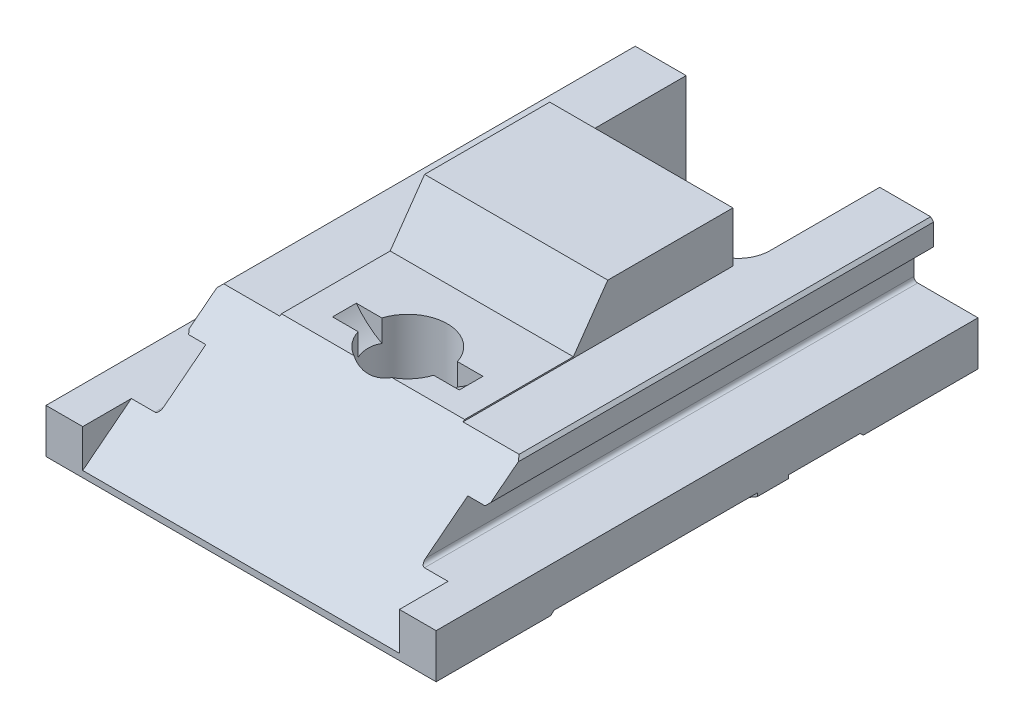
ISO-10303-21;
HEADER;
FILE_DESCRIPTION(('STEP AP214'),'2;1');
FILE_NAME('part.step','',(''),(''),'','','');
FILE_SCHEMA(('AUTOMOTIVE_DESIGN { 1 0 10303 214 1 1 1 1 }'));
ENDSEC;
DATA;
#1=APPLICATION_CONTEXT('core data for automotive mechanical design processes');
#2=APPLICATION_PROTOCOL_DEFINITION('international standard','automotive_design',2000,#1);
#3=PRODUCT_CONTEXT('',#1,'mechanical');
#4=PRODUCT('Part','Part','',(#3));
#5=PRODUCT_RELATED_PRODUCT_CATEGORY('part','',(#4));
#6=PRODUCT_DEFINITION_FORMATION('','',#4);
#7=PRODUCT_DEFINITION_CONTEXT('part definition',#1,'design');
#8=PRODUCT_DEFINITION('design','',#6,#7);
#9=PRODUCT_DEFINITION_SHAPE('','',#8);
#10=(LENGTH_UNIT() NAMED_UNIT(*) SI_UNIT(.MILLI.,.METRE.));
#11=(NAMED_UNIT(*) PLANE_ANGLE_UNIT() SI_UNIT($,.RADIAN.));
#12=(NAMED_UNIT(*) SI_UNIT($,.STERADIAN.) SOLID_ANGLE_UNIT());
#13=UNCERTAINTY_MEASURE_WITH_UNIT(LENGTH_MEASURE(1.E-05),#10,'distance_accuracy_value','');
#14=(GEOMETRIC_REPRESENTATION_CONTEXT(3) GLOBAL_UNCERTAINTY_ASSIGNED_CONTEXT((#13)) GLOBAL_UNIT_ASSIGNED_CONTEXT((#10,
#11,#12)) REPRESENTATION_CONTEXT('',''));
#15=CARTESIAN_POINT('',(0.,0.,0.));
#16=DIRECTION('',(0.,0.,1.));
#17=DIRECTION('',(1.,0.,0.));
#18=AXIS2_PLACEMENT_3D('',#15,#16,#17);
#19=CARTESIAN_POINT('',(-19.558,-15.5956,42.516425));
#20=DIRECTION('',(0.,0.707106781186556,0.707106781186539));
#21=DIRECTION('',(0.,-0.707106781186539,0.707106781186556));
#22=AXIS2_PLACEMENT_3D('',#19,#20,#21);
#23=PLANE('',#22);
#24=DIRECTION('',(1.,0.,0.));
#25=VECTOR('',#24,1.);
#26=CARTESIAN_POINT('',(-19.558,-15.5956,42.516425));
#27=LINE('',#26,#25);
#28=CARTESIAN_POINT('',(-19.558,-15.5956,42.516425));
#29=VERTEX_POINT('',#28);
#30=CARTESIAN_POINT('',(-2.6213485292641,-15.5956,42.516425));
#31=VERTEX_POINT('',#30);
#32=EDGE_CURVE('E420',#29,#31,#27,.T.);
#33=ORIENTED_EDGE('',*,*,#32,.T.);
#34=CARTESIAN_POINT('',(-2.62129838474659,-15.5954,42.516225));
#35=CARTESIAN_POINT('',(-2.63404406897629,-15.6462452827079,42.5670702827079));
#36=CARTESIAN_POINT('',(-2.64670322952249,-15.6971012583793,42.6179262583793));
#37=CARTESIAN_POINT('',(-2.67184850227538,-15.7988345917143,42.7196595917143));
#38=CARTESIAN_POINT('',(-2.68433461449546,-15.8497119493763,42.7705369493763));
#39=CARTESIAN_POINT('',(-2.69673420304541,-15.9006,42.821425));
#40=B_SPLINE_CURVE_WITH_KNOTS('',3,(#34,#35,#36,#37,#38,#39),.UNSPECIFIED.,.F.,.F.,(4,2,4),(0.,
0.219080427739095,0.438160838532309),.UNSPECIFIED.);
#41=CARTESIAN_POINT('',(-2.69668546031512,-15.9004,42.821225));
#42=VERTEX_POINT('',#41);
#43=EDGE_CURVE('E52',#31,#42,#40,.T.);
#44=ORIENTED_EDGE('',*,*,#43,.T.);
#45=DIRECTION('',(1.,0.,0.));
#46=VECTOR('',#45,1.);
#47=CARTESIAN_POINT('',(-19.558,-15.9004,42.821225));
#48=LINE('',#47,#46);
#49=CARTESIAN_POINT('',(-19.558,-15.9004,42.821225));
#50=VERTEX_POINT('',#49);
#51=EDGE_CURVE('E414',#50,#42,#48,.T.);
#52=ORIENTED_EDGE('',*,*,#51,.F.);
#53=DIRECTION('',(0.,-0.70710678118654,0.707106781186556));
#54=VECTOR('',#53,1.);
#55=CARTESIAN_POINT('',(-19.558,-15.5956,42.516425));
#56=LINE('',#55,#54);
#57=EDGE_CURVE('E875',#29,#50,#56,.T.);
#58=ORIENTED_EDGE('',*,*,#57,.F.);
#59=EDGE_LOOP('',(#33,#44,#52,#58));
#60=FACE_BOUND('',#59,.T.);
#61=ADVANCED_FACE('F37',(#60),#23,.F.);
#62=CARTESIAN_POINT('',(0.,-17.1196,37.6174));
#63=DIRECTION('',(0.,1.,0.));
#64=DIRECTION('',(0.,0.,1.));
#65=AXIS2_PLACEMENT_3D('',#62,#63,#64);
#66=CYLINDRICAL_SURFACE('',#65,3.96875);
#67=CARTESIAN_POINT('',(0.,-14.0081,37.6174));
#68=DIRECTION('',(0.,-1.,0.));
#69=DIRECTION('',(0.,0.,-1.));
#70=AXIS2_PLACEMENT_3D('',#67,#68,#69);
#71=CIRCLE('',#70,3.96875);
#72=CARTESIAN_POINT('',(0.,-14.0081,33.64865));
#73=VERTEX_POINT('',#72);
#74=EDGE_CURVE('E1012',#73,#73,#71,.T.);
#75=ORIENTED_EDGE('',*,*,#74,.T.);
#76=EDGE_LOOP('',(#75));
#77=FACE_BOUND('',#76,.T.);
#78=DIRECTION('',(0.,1.,0.));
#79=VECTOR('',#78,1.);
#80=CARTESIAN_POINT('',(3.78594620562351,-17.1196,36.426775));
#81=LINE('',#80,#79);
#82=CARTESIAN_POINT('',(3.78594620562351,-4.9276,36.426775));
#83=VERTEX_POINT('',#82);
#84=CARTESIAN_POINT('',(3.78594620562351,-7.14152584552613,36.426775));
#85=VERTEX_POINT('',#84);
#86=EDGE_CURVE('E647',#83,#85,#81,.F.);
#87=ORIENTED_EDGE('',*,*,#86,.F.);
#88=CARTESIAN_POINT('',(0.,-4.9276,37.6174));
#89=DIRECTION('',(0.,-1.,0.));
#90=DIRECTION('',(0.,0.,-1.));
#91=AXIS2_PLACEMENT_3D('',#88,#89,#90);
#92=CIRCLE('',#91,3.96875);
#93=CARTESIAN_POINT('',(-3.78594620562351,-4.9276,36.426775));
#94=VERTEX_POINT('',#93);
#95=EDGE_CURVE('E591',#83,#94,#92,.F.);
#96=ORIENTED_EDGE('',*,*,#95,.T.);
#97=DIRECTION('',(0.,1.,0.));
#98=VECTOR('',#97,1.);
#99=CARTESIAN_POINT('',(-3.78594620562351,-17.1196,36.426775));
#100=LINE('',#99,#98);
#101=CARTESIAN_POINT('',(-3.78594620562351,-7.14152584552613,36.426775));
#102=VERTEX_POINT('',#101);
#103=EDGE_CURVE('E616',#102,#94,#100,.T.);
#104=ORIENTED_EDGE('',*,*,#103,.F.);
#105=CARTESIAN_POINT('',(-3.78594620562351,-7.14152584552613,36.426775));
#106=CARTESIAN_POINT('',(-3.81564694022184,-7.12539605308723,36.5211730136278));
#107=CARTESIAN_POINT('',(-3.84187921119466,-7.11092584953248,36.6169673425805));
#108=CARTESIAN_POINT('',(-3.88717841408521,-7.08568295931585,36.8107426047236));
#109=CARTESIAN_POINT('',(-3.90624307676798,-7.07491144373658,36.9087242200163));
#110=CARTESIAN_POINT('',(-3.93651806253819,-7.05770586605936,37.1033690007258));
#111=CARTESIAN_POINT('',(-3.94793841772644,-7.05115601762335,37.1999890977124));
#112=CARTESIAN_POINT('',(-3.96365050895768,-7.0421245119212,37.3939779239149));
#113=CARTESIAN_POINT('',(-3.96794366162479,-7.03964204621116,37.4913465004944));
#114=CARTESIAN_POINT('',(-3.96938292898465,-7.03881136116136,37.6907837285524));
#115=CARTESIAN_POINT('',(-3.96617993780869,-7.04066508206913,37.792855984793));
#116=CARTESIAN_POINT('',(-3.95193846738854,-7.0488599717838,37.9962969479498));
#117=CARTESIAN_POINT('',(-3.94089771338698,-7.05520244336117,38.0976654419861));
#118=CARTESIAN_POINT('',(-3.91066017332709,-7.0724127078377,38.3020184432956));
#119=CARTESIAN_POINT('',(-3.8912211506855,-7.08341469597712,38.4049556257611));
#120=CARTESIAN_POINT('',(-3.84444102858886,-7.10951071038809,38.6084496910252));
#121=CARTESIAN_POINT('',(-3.81710301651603,-7.12460313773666,38.7090074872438));
#122=CARTESIAN_POINT('',(-3.78594620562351,-7.14152584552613,38.808025));
#123=B_SPLINE_CURVE_WITH_KNOTS('',3,(#105,#106,#107,#108,#109,#110,#111,#112,#113,#114,#115,
#116,#117,#118,#119,#120,#121,#122),.UNSPECIFIED.,.F.,.F.,(4,2,2,2,2,2,2,2,4),(0.,
0.300746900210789,0.601588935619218,0.893782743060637,1.18591846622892,1.49192812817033,
1.79802663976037,2.11361460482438,2.42907938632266),.UNSPECIFIED.);
#124=CARTESIAN_POINT('',(-3.78594620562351,-7.14152584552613,38.808025));
#125=VERTEX_POINT('',#124);
#126=EDGE_CURVE('E625',#102,#125,#123,.T.);
#127=ORIENTED_EDGE('',*,*,#126,.T.);
#128=DIRECTION('',(0.,1.,0.));
#129=VECTOR('',#128,1.);
#130=CARTESIAN_POINT('',(-3.78594620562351,-17.1196,38.808025));
#131=LINE('',#130,#129);
#132=CARTESIAN_POINT('',(-3.78594620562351,-4.9276,38.808025));
#133=VERTEX_POINT('',#132);
#134=EDGE_CURVE('E632',#125,#133,#131,.T.);
#135=ORIENTED_EDGE('',*,*,#134,.T.);
#136=CARTESIAN_POINT('',(-1.90543841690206,-4.9276,41.0988193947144));
#137=VERTEX_POINT('',#136);
#138=EDGE_CURVE('E586',#133,#137,#92,.F.);
#139=ORIENTED_EDGE('',*,*,#138,.T.);
#140=CARTESIAN_POINT('',(0.,-2.20761706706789,37.6174));
#141=DIRECTION('',(0.,-0.788010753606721,-0.61566147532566));
#142=DIRECTION('',(0.,0.61566147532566,-0.788010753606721));
#143=AXIS2_PLACEMENT_3D('',#140,#141,#142);
#144=ELLIPSE('',#143,5.03641604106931,3.96875);
#145=CARTESIAN_POINT('',(1.90543841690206,-4.9276,41.0988193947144));
#146=VERTEX_POINT('',#145);
#147=EDGE_CURVE('E590',#137,#146,#144,.F.);
#148=ORIENTED_EDGE('',*,*,#147,.T.);
#149=CARTESIAN_POINT('',(3.78594620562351,-4.9276,38.808025));
#150=VERTEX_POINT('',#149);
#151=EDGE_CURVE('E587',#146,#150,#92,.F.);
#152=ORIENTED_EDGE('',*,*,#151,.T.);
#153=DIRECTION('',(0.,1.,0.));
#154=VECTOR('',#153,1.);
#155=CARTESIAN_POINT('',(3.78594620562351,-17.1196,38.808025));
#156=LINE('',#155,#154);
#157=CARTESIAN_POINT('',(3.78594620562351,-7.14152584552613,38.808025));
#158=VERTEX_POINT('',#157);
#159=EDGE_CURVE('E636',#150,#158,#156,.F.);
#160=ORIENTED_EDGE('',*,*,#159,.T.);
#161=CARTESIAN_POINT('',(3.78594620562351,-7.14152584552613,38.808025));
#162=CARTESIAN_POINT('',(3.81564694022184,-7.12539605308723,38.7136269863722));
#163=CARTESIAN_POINT('',(3.84187921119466,-7.11092584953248,38.6178326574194));
#164=CARTESIAN_POINT('',(3.88717841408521,-7.08568295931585,38.4240573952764));
#165=CARTESIAN_POINT('',(3.90624307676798,-7.07491144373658,38.3260757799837));
#166=CARTESIAN_POINT('',(3.93651806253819,-7.05770586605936,38.1314309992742));
#167=CARTESIAN_POINT('',(3.94793841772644,-7.05115601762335,38.0348109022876));
#168=CARTESIAN_POINT('',(3.96365050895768,-7.0421245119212,37.8408220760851));
#169=CARTESIAN_POINT('',(3.96794366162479,-7.03964204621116,37.7434534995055));
#170=CARTESIAN_POINT('',(3.96938292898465,-7.03881136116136,37.5440162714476));
#171=CARTESIAN_POINT('',(3.96617993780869,-7.04066508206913,37.4419440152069));
#172=CARTESIAN_POINT('',(3.95193846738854,-7.0488599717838,37.2385030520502));
#173=CARTESIAN_POINT('',(3.94089771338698,-7.05520244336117,37.1371345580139));
#174=CARTESIAN_POINT('',(3.91066017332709,-7.0724127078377,36.9327815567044));
#175=CARTESIAN_POINT('',(3.8912211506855,-7.08341469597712,36.8298443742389));
#176=CARTESIAN_POINT('',(3.84444102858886,-7.10951071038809,36.6263503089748));
#177=CARTESIAN_POINT('',(3.81710301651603,-7.12460313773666,36.5257925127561));
#178=CARTESIAN_POINT('',(3.78594620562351,-7.14152584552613,36.426775));
#179=B_SPLINE_CURVE_WITH_KNOTS('',3,(#161,#162,#163,#164,#165,#166,#167,#168,#169,#170,#171,
#172,#173,#174,#175,#176,#177,#178),.UNSPECIFIED.,.F.,.F.,(4,2,2,2,2,2,2,2,4),(0.,
0.300746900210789,0.601588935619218,0.893782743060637,1.18591846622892,1.49192812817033,
1.79802663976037,2.11361460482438,2.42907938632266),.UNSPECIFIED.);
#180=EDGE_CURVE('E649',#158,#85,#179,.T.);
#181=ORIENTED_EDGE('',*,*,#180,.T.);
#182=EDGE_LOOP('',(#87,#96,#104,#127,#135,#139,#148,#152,#160,#181));
#183=FACE_BOUND('',#182,.T.);
#184=ADVANCED_FACE('F661',(#77,#183),#66,.F.);
#185=CARTESIAN_POINT('',(-15.875,-4.9276,30.1965426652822));
#186=DIRECTION('',(0.,-1.,0.));
#187=DIRECTION('',(0.,0.,-1.));
#188=AXIS2_PLACEMENT_3D('',#185,#186,#187);
#189=PLANE('',#188);
#190=DIRECTION('',(-1.,0.,0.));
#191=VECTOR('',#190,1.);
#192=CARTESIAN_POINT('',(-6.35,-4.9276,36.426775));
#193=LINE('',#192,#191);
#194=CARTESIAN_POINT('',(6.35,-4.9276,36.426775));
#195=VERTEX_POINT('',#194);
#196=EDGE_CURVE('E626',#195,#83,#193,.T.);
#197=ORIENTED_EDGE('',*,*,#196,.F.);
#198=DIRECTION('',(0.,0.,1.));
#199=VECTOR('',#198,1.);
#200=CARTESIAN_POINT('',(6.35,-4.9276,36.426775));
#201=LINE('',#200,#199);
#202=CARTESIAN_POINT('',(6.35,-4.9276,38.808025));
#203=VERTEX_POINT('',#202);
#204=EDGE_CURVE('E633',#195,#203,#201,.T.);
#205=ORIENTED_EDGE('',*,*,#204,.T.);
#206=DIRECTION('',(-1.,0.,0.));
#207=VECTOR('',#206,1.);
#208=CARTESIAN_POINT('',(-6.35,-4.9276,38.808025));
#209=LINE('',#208,#207);
#210=EDGE_CURVE('E641',#203,#150,#209,.T.);
#211=ORIENTED_EDGE('',*,*,#210,.T.);
#212=ORIENTED_EDGE('',*,*,#151,.F.);
#213=DIRECTION('',(1.,0.,0.));
#214=VECTOR('',#213,1.);
#215=CARTESIAN_POINT('',(-15.875,-4.9276,41.0988193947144));
#216=LINE('',#215,#214);
#217=CARTESIAN_POINT('',(9.1821,-4.9276,41.0988193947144));
#218=VERTEX_POINT('',#217);
#219=EDGE_CURVE('E927',#146,#218,#216,.T.);
#220=ORIENTED_EDGE('',*,*,#219,.T.);
#221=DIRECTION('',(0.,0.,1.));
#222=VECTOR('',#221,1.);
#223=CARTESIAN_POINT('',(9.1821,-4.9276,54.3306));
#224=LINE('',#223,#222);
#225=CARTESIAN_POINT('',(9.1821,-4.9276,30.1965426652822));
#226=VERTEX_POINT('',#225);
#227=EDGE_CURVE('E917',#226,#218,#224,.T.);
#228=ORIENTED_EDGE('',*,*,#227,.F.);
#229=DIRECTION('',(1.,0.,0.));
#230=VECTOR('',#229,1.);
#231=CARTESIAN_POINT('',(-15.875,-4.9276,30.1965426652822));
#232=LINE('',#231,#230);
#233=CARTESIAN_POINT('',(-9.1821,-4.9276,30.1965426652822));
#234=VERTEX_POINT('',#233);
#235=EDGE_CURVE('E920',#234,#226,#232,.T.);
#236=ORIENTED_EDGE('',*,*,#235,.F.);
#237=DIRECTION('',(0.,0.,-1.));
#238=VECTOR('',#237,1.);
#239=CARTESIAN_POINT('',(-9.1821,-4.9276,54.3306));
#240=LINE('',#239,#238);
#241=CARTESIAN_POINT('',(-9.1821,-4.9276,41.0988193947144));
#242=VERTEX_POINT('',#241);
#243=EDGE_CURVE('E913',#242,#234,#240,.T.);
#244=ORIENTED_EDGE('',*,*,#243,.F.);
#245=EDGE_CURVE('E926',#242,#137,#216,.T.);
#246=ORIENTED_EDGE('',*,*,#245,.T.);
#247=ORIENTED_EDGE('',*,*,#138,.F.);
#248=DIRECTION('',(-1.,0.,0.));
#249=VECTOR('',#248,1.);
#250=CARTESIAN_POINT('',(-15.875,-4.9276,38.808025));
#251=LINE('',#250,#249);
#252=CARTESIAN_POINT('',(-6.35,-4.9276,38.808025));
#253=VERTEX_POINT('',#252);
#254=EDGE_CURVE('E607',#133,#253,#251,.T.);
#255=ORIENTED_EDGE('',*,*,#254,.T.);
#256=DIRECTION('',(0.,0.,1.));
#257=VECTOR('',#256,1.);
#258=CARTESIAN_POINT('',(-6.35,-4.9276,36.426775));
#259=LINE('',#258,#257);
#260=CARTESIAN_POINT('',(-6.35,-4.9276,36.426775));
#261=VERTEX_POINT('',#260);
#262=EDGE_CURVE('E623',#261,#253,#259,.T.);
#263=ORIENTED_EDGE('',*,*,#262,.F.);
#264=DIRECTION('',(-1.,0.,0.));
#265=VECTOR('',#264,1.);
#266=CARTESIAN_POINT('',(-15.875,-4.9276,36.426775));
#267=LINE('',#266,#265);
#268=EDGE_CURVE('E45',#94,#261,#267,.T.);
#269=ORIENTED_EDGE('',*,*,#268,.F.);
#270=ORIENTED_EDGE('',*,*,#95,.F.);
#271=EDGE_LOOP('',(#197,#205,#211,#212,#220,#228,#236,#244,#246,#247,#255,#263,#269,#270));
#272=FACE_BOUND('',#271,.T.);
#273=ADVANCED_FACE('F630',(#272),#189,.F.);
#274=CARTESIAN_POINT('',(-15.113,-7.5184,54.3306));
#275=DIRECTION('',(0.707106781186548,0.707106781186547,0.));
#276=DIRECTION('',(-0.707106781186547,0.707106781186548,0.));
#277=AXIS2_PLACEMENT_3D('',#274,#275,#276);
#278=PLANE('',#277);
#279=DIRECTION('',(0.577350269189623,-0.577350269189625,-0.577350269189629));
#280=VECTOR('',#279,1.);
#281=CARTESIAN_POINT('',(-18.2314931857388,-4.39990681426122,48.0936136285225));
#282=LINE('',#281,#280);
#283=CARTESIAN_POINT('',(-14.8672795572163,-7.76412044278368,44.7294));
#284=VERTEX_POINT('',#283);
#285=CARTESIAN_POINT('',(-14.8082,-7.8232,44.6703204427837));
#286=VERTEX_POINT('',#285);
#287=EDGE_CURVE('E1484',#284,#286,#282,.T.);
#288=ORIENTED_EDGE('',*,*,#287,.F.);
#289=DIRECTION('',(-0.524268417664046,0.524268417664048,-0.671032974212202));
#290=VECTOR('',#289,1.);
#291=CARTESIAN_POINT('',(-11.6246401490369,-11.0067598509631,48.8797891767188));
#292=LINE('',#291,#290);
#293=CARTESIAN_POINT('',(-15.113,-7.5184,44.4148921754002));
#294=VERTEX_POINT('',#293);
#295=EDGE_CURVE('E963',#284,#294,#292,.T.);
#296=ORIENTED_EDGE('',*,*,#295,.T.);
#297=DIRECTION('',(0.,0.,-1.));
#298=VECTOR('',#297,1.);
#299=CARTESIAN_POINT('',(-15.113,-7.5184,54.3306));
#300=LINE('',#299,#298);
#301=CARTESIAN_POINT('',(-15.113,-7.5184,0.));
#302=VERTEX_POINT('',#301);
#303=EDGE_CURVE('E551',#294,#302,#300,.T.);
#304=ORIENTED_EDGE('',*,*,#303,.T.);
#305=DIRECTION('',(0.707106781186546,-0.707106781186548,0.));
#306=VECTOR('',#305,1.);
#307=CARTESIAN_POINT('',(-15.113,-7.5184,0.));
#308=LINE('',#307,#306);
#309=CARTESIAN_POINT('',(-14.8082,-7.8232,0.));
#310=VERTEX_POINT('',#309);
#311=EDGE_CURVE('E468',#302,#310,#308,.T.);
#312=ORIENTED_EDGE('',*,*,#311,.T.);
#313=DIRECTION('',(0.,0.,-1.));
#314=VECTOR('',#313,1.);
#315=CARTESIAN_POINT('',(-14.8082,-7.8232,54.3306));
#316=LINE('',#315,#314);
#317=EDGE_CURVE('E549',#286,#310,#316,.T.);
#318=ORIENTED_EDGE('',*,*,#317,.F.);
#319=EDGE_LOOP('',(#288,#296,#304,#312,#318));
#320=FACE_BOUND('',#319,.T.);
#321=ADVANCED_FACE('F696',(#320),#278,.F.);
#322=CARTESIAN_POINT('',(-14.8082,-7.8232,54.3306));
#323=DIRECTION('',(0.,1.,0.));
#324=DIRECTION('',(0.,0.,1.));
#325=AXIS2_PLACEMENT_3D('',#322,#323,#324);
#326=PLANE('',#325);
#327=DIRECTION('',(1.,0.,0.));
#328=VECTOR('',#327,1.);
#329=CARTESIAN_POINT('',(-14.8082,-7.8232,44.6703204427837));
#330=LINE('',#329,#328);
#331=CARTESIAN_POINT('',(-13.5128,-7.8232,44.6703204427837));
#332=VERTEX_POINT('',#331);
#333=EDGE_CURVE('E1487',#286,#332,#330,.T.);
#334=ORIENTED_EDGE('',*,*,#333,.F.);
#335=ORIENTED_EDGE('',*,*,#317,.T.);
#336=DIRECTION('',(1.,0.,0.));
#337=VECTOR('',#336,1.);
#338=CARTESIAN_POINT('',(-14.8082,-7.8232,0.));
#339=LINE('',#338,#337);
#340=CARTESIAN_POINT('',(-13.5128,-7.8232,0.));
#341=VERTEX_POINT('',#340);
#342=EDGE_CURVE('E471',#310,#341,#339,.T.);
#343=ORIENTED_EDGE('',*,*,#342,.T.);
#344=DIRECTION('',(0.,0.,-1.));
#345=VECTOR('',#344,1.);
#346=CARTESIAN_POINT('',(-13.5128,-7.8232,54.3306));
#347=LINE('',#346,#345);
#348=EDGE_CURVE('E547',#332,#341,#347,.T.);
#349=ORIENTED_EDGE('',*,*,#348,.F.);
#350=EDGE_LOOP('',(#334,#335,#343,#349));
#351=FACE_BOUND('',#350,.T.);
#352=ADVANCED_FACE('F709',(#351),#326,.F.);
#353=CARTESIAN_POINT('',(-13.5128,-8.2042,54.3306));
#354=DIRECTION('',(0.,0.,-1.));
#355=DIRECTION('',(-1.,0.,0.));
#356=AXIS2_PLACEMENT_3D('',#353,#354,#355);
#357=CYLINDRICAL_SURFACE('',#356,0.380999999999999);
#358=CARTESIAN_POINT('',(-13.5128,-8.2042,44.2893204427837));
#359=DIRECTION('',(0.,-0.70710678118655,0.707106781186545));
#360=DIRECTION('',(0.,-0.707106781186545,-0.70710678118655));
#361=AXIS2_PLACEMENT_3D('',#358,#359,#360);
#362=ELLIPSE('',#361,0.53881536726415,0.380999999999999);
#363=CARTESIAN_POINT('',(-13.1318,-8.2042,44.2893204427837));
#364=VERTEX_POINT('',#363);
#365=EDGE_CURVE('E1492',#332,#364,#362,.F.);
#366=ORIENTED_EDGE('',*,*,#365,.F.);
#367=ORIENTED_EDGE('',*,*,#348,.T.);
#368=CARTESIAN_POINT('',(-13.5128,-8.2042,0.));
#369=DIRECTION('',(0.,0.,-1.));
#370=DIRECTION('',(1.,0.,0.));
#371=AXIS2_PLACEMENT_3D('',#368,#369,#370);
#372=CIRCLE('',#371,0.380999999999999);
#373=CARTESIAN_POINT('',(-13.1318,-8.2042,0.));
#374=VERTEX_POINT('',#373);
#375=EDGE_CURVE('E474',#341,#374,#372,.T.);
#376=ORIENTED_EDGE('',*,*,#375,.T.);
#377=DIRECTION('',(0.,0.,-1.));
#378=VECTOR('',#377,1.);
#379=CARTESIAN_POINT('',(-13.1318,-8.2042,54.3306));
#380=LINE('',#379,#378);
#381=EDGE_CURVE('E545',#364,#374,#380,.T.);
#382=ORIENTED_EDGE('',*,*,#381,.F.);
#383=EDGE_LOOP('',(#366,#367,#376,#382));
#384=FACE_BOUND('',#383,.T.);
#385=ADVANCED_FACE('F700',(#384),#357,.F.);
#386=CARTESIAN_POINT('',(-15.875,-4.9276,41.0988193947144));
#387=DIRECTION('',(0.,-0.788010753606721,-0.61566147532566));
#388=DIRECTION('',(0.,0.61566147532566,-0.788010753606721));
#389=AXIS2_PLACEMENT_3D('',#386,#387,#388);
#390=PLANE('',#389);
#391=DIRECTION('',(-1.,0.,0.));
#392=VECTOR('',#391,1.);
#393=CARTESIAN_POINT('',(-15.875,-7.76412044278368,44.7294));
#394=LINE('',#393,#392);
#395=CARTESIAN_POINT('',(-13.1318,-7.76412044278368,44.7294));
#396=VERTEX_POINT('',#395);
#397=EDGE_CURVE('E605',#396,#284,#394,.T.);
#398=ORIENTED_EDGE('',*,*,#397,.F.);
#399=DIRECTION('',(0.,0.61566147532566,-0.788010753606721));
#400=VECTOR('',#399,1.);
#401=CARTESIAN_POINT('',(-13.1318,-12.5889294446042,50.90487390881));
#402=LINE('',#401,#400);
#403=CARTESIAN_POINT('',(-13.1318,-11.0744,48.9663646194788));
#404=VERTEX_POINT('',#403);
#405=EDGE_CURVE('E961',#404,#396,#402,.T.);
#406=ORIENTED_EDGE('',*,*,#405,.F.);
#407=CARTESIAN_POINT('',(-13.5128,-11.0744,48.9663646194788));
#408=DIRECTION('',(0.,-0.788010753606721,-0.61566147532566));
#409=DIRECTION('',(0.,0.61566147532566,-0.788010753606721));
#410=AXIS2_PLACEMENT_3D('',#407,#408,#409);
#411=ELLIPSE('',#410,0.618846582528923,0.380999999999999);
#412=CARTESIAN_POINT('',(-13.5128,-11.4554,49.4540223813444));
#413=VERTEX_POINT('',#412);
#414=EDGE_CURVE('E958',#413,#404,#411,.F.);
#415=ORIENTED_EDGE('',*,*,#414,.F.);
#416=DIRECTION('',(1.,0.,0.));
#417=VECTOR('',#416,1.);
#418=CARTESIAN_POINT('',(-13.5128,-11.4554,49.4540223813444));
#419=LINE('',#418,#417);
#420=CARTESIAN_POINT('',(-15.875,-11.4554,49.4540223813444));
#421=VERTEX_POINT('',#420);
#422=EDGE_CURVE('E955',#421,#413,#419,.T.);
#423=ORIENTED_EDGE('',*,*,#422,.F.);
#424=DIRECTION('',(0.,0.61566147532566,-0.788010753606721));
#425=VECTOR('',#424,1.);
#426=CARTESIAN_POINT('',(-15.875,-4.9276,41.0988193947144));
#427=LINE('',#426,#425);
#428=CARTESIAN_POINT('',(-15.875,-15.2654,54.3306));
#429=VERTEX_POINT('',#428);
#430=EDGE_CURVE('E908',#429,#421,#427,.T.);
#431=ORIENTED_EDGE('',*,*,#430,.F.);
#432=DIRECTION('',(1.,0.,0.));
#433=VECTOR('',#432,1.);
#434=CARTESIAN_POINT('',(-15.875,-15.2654,54.3306));
#435=LINE('',#434,#433);
#436=CARTESIAN_POINT('',(15.875,-15.2654,54.3306));
#437=VERTEX_POINT('',#436);
#438=EDGE_CURVE('E905',#429,#437,#435,.T.);
#439=ORIENTED_EDGE('',*,*,#438,.T.);
#440=DIRECTION('',(0.,0.61566147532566,-0.788010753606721));
#441=VECTOR('',#440,1.);
#442=CARTESIAN_POINT('',(15.875,-4.9276,41.0988193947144));
#443=LINE('',#442,#441);
#444=CARTESIAN_POINT('',(15.875,-11.4554,49.4540223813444));
#445=VERTEX_POINT('',#444);
#446=EDGE_CURVE('E907',#437,#445,#443,.T.);
#447=ORIENTED_EDGE('',*,*,#446,.T.);
#448=DIRECTION('',(1.,0.,0.));
#449=VECTOR('',#448,1.);
#450=CARTESIAN_POINT('',(13.5128,-11.4554,49.4540223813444));
#451=LINE('',#450,#449);
#452=CARTESIAN_POINT('',(13.5128,-11.4554,49.4540223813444));
#453=VERTEX_POINT('',#452);
#454=EDGE_CURVE('E944',#453,#445,#451,.T.);
#455=ORIENTED_EDGE('',*,*,#454,.F.);
#456=CARTESIAN_POINT('',(13.5128,-11.0744,48.9663646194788));
#457=DIRECTION('',(0.,-0.788010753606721,-0.61566147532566));
#458=DIRECTION('',(0.,0.61566147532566,-0.788010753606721));
#459=AXIS2_PLACEMENT_3D('',#456,#457,#458);
#460=ELLIPSE('',#459,0.618846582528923,0.380999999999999);
#461=CARTESIAN_POINT('',(13.1318,-11.0744,48.9663646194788));
#462=VERTEX_POINT('',#461);
#463=EDGE_CURVE('E941',#462,#453,#460,.F.);
#464=ORIENTED_EDGE('',*,*,#463,.F.);
#465=DIRECTION('',(0.,-0.61566147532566,0.788010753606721));
#466=VECTOR('',#465,1.);
#467=CARTESIAN_POINT('',(13.1318,-12.5889294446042,50.90487390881));
#468=LINE('',#467,#466);
#469=CARTESIAN_POINT('',(13.1318,-7.76412044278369,44.7294));
#470=VERTEX_POINT('',#469);
#471=EDGE_CURVE('E938',#470,#462,#468,.T.);
#472=ORIENTED_EDGE('',*,*,#471,.F.);
#473=DIRECTION('',(-1.,0.,0.));
#474=VECTOR('',#473,1.);
#475=CARTESIAN_POINT('',(-15.875,-7.76412044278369,44.7294));
#476=LINE('',#475,#474);
#477=CARTESIAN_POINT('',(14.8672795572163,-7.76412044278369,44.7294));
#478=VERTEX_POINT('',#477);
#479=EDGE_CURVE('E602',#478,#470,#476,.T.);
#480=ORIENTED_EDGE('',*,*,#479,.F.);
#481=DIRECTION('',(-0.524268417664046,-0.524268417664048,0.671032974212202));
#482=VECTOR('',#481,1.);
#483=CARTESIAN_POINT('',(11.6246401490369,-11.0067598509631,48.8797891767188));
#484=LINE('',#483,#482);
#485=CARTESIAN_POINT('',(15.113,-7.5184,44.4148921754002));
#486=VERTEX_POINT('',#485);
#487=EDGE_CURVE('E935',#486,#478,#484,.T.);
#488=ORIENTED_EDGE('',*,*,#487,.F.);
#489=DIRECTION('',(0.,-0.61566147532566,0.788010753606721));
#490=VECTOR('',#489,1.);
#491=CARTESIAN_POINT('',(15.113,-11.5106391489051,49.524725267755));
#492=LINE('',#491,#490);
#493=CARTESIAN_POINT('',(15.113,-5.3594,41.6514981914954));
#494=VERTEX_POINT('',#493);
#495=EDGE_CURVE('E932',#494,#486,#492,.T.);
#496=ORIENTED_EDGE('',*,*,#495,.F.);
#497=DIRECTION('',(0.524268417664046,-0.524268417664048,0.671032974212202));
#498=VECTOR('',#497,1.);
#499=CARTESIAN_POINT('',(19.4059726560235,-9.65237265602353,47.1462526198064));
#500=LINE('',#499,#498);
#501=CARTESIAN_POINT('',(14.8082,-5.0546,41.2613719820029));
#502=VERTEX_POINT('',#501);
#503=EDGE_CURVE('E946',#502,#494,#500,.T.);
#504=ORIENTED_EDGE('',*,*,#503,.F.);
#505=DIRECTION('',(1.,0.,0.));
#506=VECTOR('',#505,1.);
#507=CARTESIAN_POINT('',(9.1821,-5.0546,41.2613719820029));
#508=LINE('',#507,#506);
#509=CARTESIAN_POINT('',(9.1821,-5.0546,41.2613719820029));
#510=VERTEX_POINT('',#509);
#511=EDGE_CURVE('E949',#510,#502,#508,.T.);
#512=ORIENTED_EDGE('',*,*,#511,.F.);
#513=DIRECTION('',(0.,-0.61566147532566,0.788010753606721));
#514=VECTOR('',#513,1.);
#515=CARTESIAN_POINT('',(9.1821,-9.47921725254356,46.9246238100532));
#516=LINE('',#515,#514);
#517=EDGE_CURVE('E952',#218,#510,#516,.T.);
#518=ORIENTED_EDGE('',*,*,#517,.F.);
#519=ORIENTED_EDGE('',*,*,#219,.F.);
#520=ORIENTED_EDGE('',*,*,#147,.F.);
#521=ORIENTED_EDGE('',*,*,#245,.F.);
#522=DIRECTION('',(0.,0.61566147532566,-0.788010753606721));
#523=VECTOR('',#522,1.);
#524=CARTESIAN_POINT('',(-9.1821,-9.47921725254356,46.9246238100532));
#525=LINE('',#524,#523);
#526=CARTESIAN_POINT('',(-9.1821,-5.0546,41.2613719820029));
#527=VERTEX_POINT('',#526);
#528=EDGE_CURVE('E974',#527,#242,#525,.T.);
#529=ORIENTED_EDGE('',*,*,#528,.F.);
#530=DIRECTION('',(1.,0.,0.));
#531=VECTOR('',#530,1.);
#532=CARTESIAN_POINT('',(-9.1821,-5.0546,41.2613719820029));
#533=LINE('',#532,#531);
#534=CARTESIAN_POINT('',(-14.8082,-5.0546,41.2613719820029));
#535=VERTEX_POINT('',#534);
#536=EDGE_CURVE('E971',#535,#527,#533,.T.);
#537=ORIENTED_EDGE('',*,*,#536,.F.);
#538=DIRECTION('',(0.524268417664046,0.524268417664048,-0.671032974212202));
#539=VECTOR('',#538,1.);
#540=CARTESIAN_POINT('',(-19.4059726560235,-9.65237265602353,47.1462526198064));
#541=LINE('',#540,#539);
#542=CARTESIAN_POINT('',(-15.113,-5.3594,41.6514981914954));
#543=VERTEX_POINT('',#542);
#544=EDGE_CURVE('E968',#543,#535,#541,.T.);
#545=ORIENTED_EDGE('',*,*,#544,.F.);
#546=DIRECTION('',(0.,0.61566147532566,-0.788010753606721));
#547=VECTOR('',#546,1.);
#548=CARTESIAN_POINT('',(-15.113,-11.5106391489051,49.524725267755));
#549=LINE('',#548,#547);
#550=EDGE_CURVE('E965',#294,#543,#549,.T.);
#551=ORIENTED_EDGE('',*,*,#550,.F.);
#552=ORIENTED_EDGE('',*,*,#295,.F.);
#553=EDGE_LOOP('',(#398,#406,#415,#423,#431,#439,#447,#455,#464,#472,#480,#488,#496,#504,#512,
#518,#519,#520,#521,#529,#537,#545,#551,#552));
#554=FACE_BOUND('',#553,.T.);
#555=ADVANCED_FACE('F697',(#554),#390,.F.);
#556=CARTESIAN_POINT('',(13.5128,-8.2042,54.3306));
#557=DIRECTION('',(0.,0.,-1.));
#558=DIRECTION('',(-1.,0.,0.));
#559=AXIS2_PLACEMENT_3D('',#556,#557,#558);
#560=CYLINDRICAL_SURFACE('',#559,0.380999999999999);
#561=CARTESIAN_POINT('',(13.5128,-8.2042,44.2893204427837));
#562=DIRECTION('',(0.,-0.707106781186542,0.707106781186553));
#563=DIRECTION('',(0.,-0.707106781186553,-0.707106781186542));
#564=AXIS2_PLACEMENT_3D('',#561,#562,#563);
#565=ELLIPSE('',#564,0.538815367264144,0.380999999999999);
#566=CARTESIAN_POINT('',(13.1318,-8.2042,44.2893204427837));
#567=VERTEX_POINT('',#566);
#568=CARTESIAN_POINT('',(13.5128,-7.8232,44.6703204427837));
#569=VERTEX_POINT('',#568);
#570=EDGE_CURVE('E1499',#567,#569,#565,.F.);
#571=ORIENTED_EDGE('',*,*,#570,.F.);
#572=DIRECTION('',(0.,0.,-1.));
#573=VECTOR('',#572,1.);
#574=CARTESIAN_POINT('',(13.1318,-8.2042,54.3306));
#575=LINE('',#574,#573);
#576=CARTESIAN_POINT('',(13.1318,-8.2042,0.));
#577=VERTEX_POINT('',#576);
#578=EDGE_CURVE('E517',#567,#577,#575,.T.);
#579=ORIENTED_EDGE('',*,*,#578,.T.);
#580=CARTESIAN_POINT('',(13.5128,-8.2042,0.));
#581=DIRECTION('',(0.,0.,-1.));
#582=DIRECTION('',(1.,0.,0.));
#583=AXIS2_PLACEMENT_3D('',#580,#581,#582);
#584=CIRCLE('',#583,0.380999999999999);
#585=CARTESIAN_POINT('',(13.5128,-7.8232,0.));
#586=VERTEX_POINT('',#585);
#587=EDGE_CURVE('E499',#577,#586,#584,.T.);
#588=ORIENTED_EDGE('',*,*,#587,.T.);
#589=DIRECTION('',(0.,0.,-1.));
#590=VECTOR('',#589,1.);
#591=CARTESIAN_POINT('',(13.5128,-7.8232,54.3306));
#592=LINE('',#591,#590);
#593=EDGE_CURVE('E515',#569,#586,#592,.T.);
#594=ORIENTED_EDGE('',*,*,#593,.F.);
#595=EDGE_LOOP('',(#571,#579,#588,#594));
#596=FACE_BOUND('',#595,.T.);
#597=ADVANCED_FACE('F699',(#596),#560,.F.);
#598=CARTESIAN_POINT('',(14.8082,-7.8232,54.3306));
#599=DIRECTION('',(0.,1.,0.));
#600=DIRECTION('',(0.,0.,1.));
#601=AXIS2_PLACEMENT_3D('',#598,#599,#600);
#602=PLANE('',#601);
#603=DIRECTION('',(1.,0.,0.));
#604=VECTOR('',#603,1.);
#605=CARTESIAN_POINT('',(14.8082,-7.8232,44.6703204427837));
#606=LINE('',#605,#604);
#607=CARTESIAN_POINT('',(14.8082,-7.8232,44.6703204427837));
#608=VERTEX_POINT('',#607);
#609=EDGE_CURVE('E1497',#569,#608,#606,.T.);
#610=ORIENTED_EDGE('',*,*,#609,.F.);
#611=ORIENTED_EDGE('',*,*,#593,.T.);
#612=DIRECTION('',(1.,0.,0.));
#613=VECTOR('',#612,1.);
#614=CARTESIAN_POINT('',(14.8082,-7.8232,0.));
#615=LINE('',#614,#613);
#616=CARTESIAN_POINT('',(14.8082,-7.8232,0.));
#617=VERTEX_POINT('',#616);
#618=EDGE_CURVE('E502',#586,#617,#615,.T.);
#619=ORIENTED_EDGE('',*,*,#618,.T.);
#620=DIRECTION('',(0.,0.,-1.));
#621=VECTOR('',#620,1.);
#622=CARTESIAN_POINT('',(14.8082,-7.8232,54.3306));
#623=LINE('',#622,#621);
#624=EDGE_CURVE('E513',#608,#617,#623,.T.);
#625=ORIENTED_EDGE('',*,*,#624,.F.);
#626=EDGE_LOOP('',(#610,#611,#619,#625));
#627=FACE_BOUND('',#626,.T.);
#628=ADVANCED_FACE('F706',(#627),#602,.F.);
#629=CARTESIAN_POINT('',(15.113,-7.5184,54.3306));
#630=DIRECTION('',(-0.707106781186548,0.707106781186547,0.));
#631=DIRECTION('',(-0.707106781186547,-0.707106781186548,0.));
#632=AXIS2_PLACEMENT_3D('',#629,#630,#631);
#633=PLANE('',#632);
#634=DIRECTION('',(0.577350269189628,0.577350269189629,0.57735026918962));
#635=VECTOR('',#634,1.);
#636=CARTESIAN_POINT('',(18.2314931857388,-4.39990681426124,48.0936136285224));
#637=LINE('',#636,#635);
#638=EDGE_CURVE('E1490',#608,#478,#637,.T.);
#639=ORIENTED_EDGE('',*,*,#638,.F.);
#640=ORIENTED_EDGE('',*,*,#624,.T.);
#641=DIRECTION('',(0.707106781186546,0.707106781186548,0.));
#642=VECTOR('',#641,1.);
#643=CARTESIAN_POINT('',(15.113,-7.5184,0.));
#644=LINE('',#643,#642);
#645=CARTESIAN_POINT('',(15.113,-7.5184,0.));
#646=VERTEX_POINT('',#645);
#647=EDGE_CURVE('E505',#617,#646,#644,.T.);
#648=ORIENTED_EDGE('',*,*,#647,.T.);
#649=DIRECTION('',(0.,0.,-1.));
#650=VECTOR('',#649,1.);
#651=CARTESIAN_POINT('',(15.113,-7.5184,54.3306));
#652=LINE('',#651,#650);
#653=EDGE_CURVE('E511',#486,#646,#652,.T.);
#654=ORIENTED_EDGE('',*,*,#653,.F.);
#655=ORIENTED_EDGE('',*,*,#487,.T.);
#656=EDGE_LOOP('',(#639,#640,#648,#654,#655));
#657=FACE_BOUND('',#656,.T.);
#658=ADVANCED_FACE('F1252',(#657),#633,.F.);
#659=CARTESIAN_POINT('',(13.5128,-8.2042,0.));
#660=DIRECTION('',(0.,0.,1.));
#661=DIRECTION('',(1.,0.,0.));
#662=AXIS2_PLACEMENT_3D('',#659,#660,#661);
#663=PLANE('',#662);
#664=DIRECTION('',(1.,0.,0.));
#665=VECTOR('',#664,1.);
#666=CARTESIAN_POINT('',(-19.558,-15.9004,0.));
#667=LINE('',#666,#665);
#668=CARTESIAN_POINT('',(9.7028,-15.9004,0.));
#669=VERTEX_POINT('',#668);
#670=CARTESIAN_POINT('',(19.558,-15.9004,0.));
#671=VERTEX_POINT('',#670);
#672=EDGE_CURVE('E835',#669,#671,#667,.T.);
#673=ORIENTED_EDGE('',*,*,#672,.F.);
#674=DIRECTION('',(0.,1.,0.));
#675=VECTOR('',#674,1.);
#676=CARTESIAN_POINT('',(9.7028,-17.1196,0.));
#677=LINE('',#676,#675);
#678=CARTESIAN_POINT('',(9.7028,-5.0546,0.));
#679=VERTEX_POINT('',#678);
#680=EDGE_CURVE('E798',#669,#679,#677,.T.);
#681=ORIENTED_EDGE('',*,*,#680,.T.);
#682=DIRECTION('',(-1.,0.,0.));
#683=VECTOR('',#682,1.);
#684=CARTESIAN_POINT('',(9.1821,-5.0546,0.));
#685=LINE('',#684,#683);
#686=CARTESIAN_POINT('',(14.8082,-5.0546,0.));
#687=VERTEX_POINT('',#686);
#688=EDGE_CURVE('E456',#687,#679,#685,.T.);
#689=ORIENTED_EDGE('',*,*,#688,.F.);
#690=DIRECTION('',(-0.707106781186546,0.707106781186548,0.));
#691=VECTOR('',#690,1.);
#692=CARTESIAN_POINT('',(14.8082,-5.0546,0.));
#693=LINE('',#692,#691);
#694=CARTESIAN_POINT('',(15.113,-5.3594,0.));
#695=VERTEX_POINT('',#694);
#696=EDGE_CURVE('E441',#695,#687,#693,.T.);
#697=ORIENTED_EDGE('',*,*,#696,.F.);
#698=DIRECTION('',(0.,1.,0.));
#699=VECTOR('',#698,1.);
#700=CARTESIAN_POINT('',(15.113,-5.3594,0.));
#701=LINE('',#700,#699);
#702=EDGE_CURVE('E445',#646,#695,#701,.T.);
#703=ORIENTED_EDGE('',*,*,#702,.F.);
#704=ORIENTED_EDGE('',*,*,#647,.F.);
#705=ORIENTED_EDGE('',*,*,#618,.F.);
#706=ORIENTED_EDGE('',*,*,#587,.F.);
#707=DIRECTION('',(0.,1.,0.));
#708=VECTOR('',#707,1.);
#709=CARTESIAN_POINT('',(13.1318,-8.2042,0.));
#710=LINE('',#709,#708);
#711=CARTESIAN_POINT('',(13.1318,-11.0744,0.));
#712=VERTEX_POINT('',#711);
#713=EDGE_CURVE('E496',#712,#577,#710,.T.);
#714=ORIENTED_EDGE('',*,*,#713,.F.);
#715=CARTESIAN_POINT('',(13.5128,-11.0744,0.));
#716=DIRECTION('',(0.,0.,-1.));
#717=DIRECTION('',(1.,0.,0.));
#718=AXIS2_PLACEMENT_3D('',#715,#716,#717);
#719=CIRCLE('',#718,0.380999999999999);
#720=CARTESIAN_POINT('',(13.5128,-11.4554,0.));
#721=VERTEX_POINT('',#720);
#722=EDGE_CURVE('E493',#721,#712,#719,.T.);
#723=ORIENTED_EDGE('',*,*,#722,.F.);
#724=DIRECTION('',(-1.,0.,0.));
#725=VECTOR('',#724,1.);
#726=CARTESIAN_POINT('',(13.5128,-11.4554,0.));
#727=LINE('',#726,#725);
#728=CARTESIAN_POINT('',(19.558,-11.4554,0.));
#729=VERTEX_POINT('',#728);
#730=EDGE_CURVE('E490',#729,#721,#727,.T.);
#731=ORIENTED_EDGE('',*,*,#730,.F.);
#732=DIRECTION('',(0.,1.,0.));
#733=VECTOR('',#732,1.);
#734=CARTESIAN_POINT('',(19.558,-11.4554,0.));
#735=LINE('',#734,#733);
#736=EDGE_CURVE('E488',#671,#729,#735,.T.);
#737=ORIENTED_EDGE('',*,*,#736,.F.);
#738=EDGE_LOOP('',(#673,#681,#689,#697,#703,#704,#705,#706,#714,#723,#731,#737));
#739=FACE_BOUND('',#738,.T.);
#740=ADVANCED_FACE('F1245',(#739),#663,.F.);
#741=CARTESIAN_POINT('',(-19.558,-15.5956,11.814175));
#742=DIRECTION('',(0.,0.707106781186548,-0.707106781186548));
#743=DIRECTION('',(0.,0.707106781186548,0.707106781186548));
#744=AXIS2_PLACEMENT_3D('',#741,#742,#743);
#745=PLANE('',#744);
#746=DIRECTION('',(1.,0.,0.));
#747=VECTOR('',#746,1.);
#748=CARTESIAN_POINT('',(-19.558,-15.5956,11.814175));
#749=LINE('',#748,#747);
#750=CARTESIAN_POINT('',(9.60279856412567,-15.5956,11.814175));
#751=VERTEX_POINT('',#750);
#752=CARTESIAN_POINT('',(19.558,-15.5956,11.814175));
#753=VERTEX_POINT('',#752);
#754=EDGE_CURVE('E854',#751,#753,#749,.T.);
#755=ORIENTED_EDGE('',*,*,#754,.F.);
#756=CARTESIAN_POINT('',(6.5278,-16.386175,11.0236));
#757=DIRECTION('',(0.,0.707106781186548,-0.707106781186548));
#758=DIRECTION('',(0.,0.707106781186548,0.707106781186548));
#759=AXIS2_PLACEMENT_3D('',#756,#757,#758);
#760=ELLIPSE('',#759,4.49012806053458,3.175);
#761=CARTESIAN_POINT('',(9.66541814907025,-15.9004,11.509375));
#762=VERTEX_POINT('',#761);
#763=EDGE_CURVE('E813',#751,#762,#760,.T.);
#764=ORIENTED_EDGE('',*,*,#763,.T.);
#765=DIRECTION('',(1.,0.,0.));
#766=VECTOR('',#765,1.);
#767=CARTESIAN_POINT('',(-19.558,-15.9004,11.509375));
#768=LINE('',#767,#766);
#769=CARTESIAN_POINT('',(19.558,-15.9004,11.509375));
#770=VERTEX_POINT('',#769);
#771=EDGE_CURVE('E858',#762,#770,#768,.T.);
#772=ORIENTED_EDGE('',*,*,#771,.T.);
#773=DIRECTION('',(0.,0.707106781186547,0.707106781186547));
#774=VECTOR('',#773,1.);
#775=CARTESIAN_POINT('',(19.558,-15.5956,11.814175));
#776=LINE('',#775,#774);
#777=EDGE_CURVE('E838',#770,#753,#776,.T.);
#778=ORIENTED_EDGE('',*,*,#777,.T.);
#779=EDGE_LOOP('',(#755,#764,#772,#778));
#780=FACE_BOUND('',#779,.T.);
#781=ADVANCED_FACE('F750',(#780),#745,.F.);
#782=CARTESIAN_POINT('',(-19.558,-15.9004,11.509375));
#783=DIRECTION('',(0.,1.,0.));
#784=DIRECTION('',(0.,0.,1.));
#785=AXIS2_PLACEMENT_3D('',#782,#783,#784);
#786=PLANE('',#785);
#787=CARTESIAN_POINT('',(6.5278,-15.9004,11.0236));
#788=DIRECTION('',(0.,1.,0.));
#789=DIRECTION('',(0.,0.,1.));
#790=AXIS2_PLACEMENT_3D('',#787,#788,#789);
#791=CIRCLE('',#790,3.175);
#792=CARTESIAN_POINT('',(9.7028,-15.9004,11.0236));
#793=VERTEX_POINT('',#792);
#794=EDGE_CURVE('E577',#762,#793,#791,.T.);
#795=ORIENTED_EDGE('',*,*,#794,.T.);
#796=DIRECTION('',(0.,0.,-1.));
#797=VECTOR('',#796,1.);
#798=CARTESIAN_POINT('',(9.70280000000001,-15.9004,11.509375));
#799=LINE('',#798,#797);
#800=EDGE_CURVE('E580',#793,#669,#799,.T.);
#801=ORIENTED_EDGE('',*,*,#800,.T.);
#802=ORIENTED_EDGE('',*,*,#672,.T.);
#803=DIRECTION('',(0.,0.,1.));
#804=VECTOR('',#803,1.);
#805=CARTESIAN_POINT('',(19.558,-15.9004,11.509375));
#806=LINE('',#805,#804);
#807=EDGE_CURVE('E821',#671,#770,#806,.T.);
#808=ORIENTED_EDGE('',*,*,#807,.T.);
#809=ORIENTED_EDGE('',*,*,#771,.F.);
#810=EDGE_LOOP('',(#795,#801,#802,#808,#809));
#811=FACE_BOUND('',#810,.T.);
#812=ADVANCED_FACE('F745',(#811),#786,.F.);
#813=CARTESIAN_POINT('',(14.8082,-5.0546,54.3306));
#814=DIRECTION('',(-0.707106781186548,-0.707106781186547,0.));
#815=DIRECTION('',(0.707106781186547,-0.707106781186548,0.));
#816=AXIS2_PLACEMENT_3D('',#813,#814,#815);
#817=PLANE('',#816);
#818=DIRECTION('',(0.,0.,-1.));
#819=VECTOR('',#818,1.);
#820=CARTESIAN_POINT('',(14.8082,-5.0546,54.3306));
#821=LINE('',#820,#819);
#822=EDGE_CURVE('E569',#502,#687,#821,.T.);
#823=ORIENTED_EDGE('',*,*,#822,.F.);
#824=ORIENTED_EDGE('',*,*,#503,.T.);
#825=DIRECTION('',(0.,0.,-1.));
#826=VECTOR('',#825,1.);
#827=CARTESIAN_POINT('',(15.113,-5.3594,54.3306));
#828=LINE('',#827,#826);
#829=EDGE_CURVE('E453',#494,#695,#828,.T.);
#830=ORIENTED_EDGE('',*,*,#829,.T.);
#831=ORIENTED_EDGE('',*,*,#696,.T.);
#832=EDGE_LOOP('',(#823,#824,#830,#831));
#833=FACE_BOUND('',#832,.T.);
#834=ADVANCED_FACE('F39',(#833),#817,.F.);
#835=CARTESIAN_POINT('',(9.1821,-5.0546,54.3306));
#836=DIRECTION('',(0.,-1.,0.));
#837=DIRECTION('',(0.,0.,-1.));
#838=AXIS2_PLACEMENT_3D('',#835,#836,#837);
#839=PLANE('',#838);
#840=ORIENTED_EDGE('',*,*,#822,.T.);
#841=ORIENTED_EDGE('',*,*,#688,.T.);
#842=DIRECTION('',(0.,0.,1.));
#843=VECTOR('',#842,1.);
#844=CARTESIAN_POINT('',(9.70280000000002,-5.0546,54.3306));
#845=LINE('',#844,#843);
#846=CARTESIAN_POINT('',(9.7028,-5.0546,11.0236));
#847=VERTEX_POINT('',#846);
#848=EDGE_CURVE('E818',#679,#847,#845,.T.);
#849=ORIENTED_EDGE('',*,*,#848,.T.);
#850=CARTESIAN_POINT('',(6.5278,-5.0546,11.0236));
#851=DIRECTION('',(0.,-1.,0.));
#852=DIRECTION('',(0.,0.,-1.));
#853=AXIS2_PLACEMENT_3D('',#850,#851,#852);
#854=CIRCLE('',#853,3.175);
#855=CARTESIAN_POINT('',(6.5278,-5.05460000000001,14.1986));
#856=VERTEX_POINT('',#855);
#857=EDGE_CURVE('E779',#847,#856,#854,.T.);
#858=ORIENTED_EDGE('',*,*,#857,.T.);
#859=DIRECTION('',(1.,0.,0.));
#860=VECTOR('',#859,1.);
#861=CARTESIAN_POINT('',(-15.875,-5.0546,14.1986));
#862=LINE('',#861,#860);
#863=CARTESIAN_POINT('',(9.1821,-5.0546,14.1986));
#864=VERTEX_POINT('',#863);
#865=EDGE_CURVE('E1471',#856,#864,#862,.T.);
#866=ORIENTED_EDGE('',*,*,#865,.T.);
#867=DIRECTION('',(0.,0.,-1.));
#868=VECTOR('',#867,1.);
#869=CARTESIAN_POINT('',(9.1821,-5.0546,54.3306));
#870=LINE('',#869,#868);
#871=EDGE_CURVE('E566',#510,#864,#870,.T.);
#872=ORIENTED_EDGE('',*,*,#871,.F.);
#873=ORIENTED_EDGE('',*,*,#511,.T.);
#874=EDGE_LOOP('',(#840,#841,#849,#858,#866,#872,#873));
#875=FACE_BOUND('',#874,.T.);
#876=ADVANCED_FACE('F1215',(#875),#839,.F.);
#877=CARTESIAN_POINT('',(9.1821,0.,54.3306));
#878=DIRECTION('',(-1.,0.,0.));
#879=DIRECTION('',(0.,0.,1.));
#880=AXIS2_PLACEMENT_3D('',#877,#878,#879);
#881=PLANE('',#880);
#882=ORIENTED_EDGE('',*,*,#871,.T.);
#883=DIRECTION('',(0.,1.,0.));
#884=VECTOR('',#883,1.);
#885=CARTESIAN_POINT('',(9.1821,0.,14.1986));
#886=LINE('',#885,#884);
#887=CARTESIAN_POINT('',(9.1821,0.,14.1986));
#888=VERTEX_POINT('',#887);
#889=EDGE_CURVE('E909',#864,#888,#886,.T.);
#890=ORIENTED_EDGE('',*,*,#889,.T.);
#891=DIRECTION('',(0.,0.,-1.));
#892=VECTOR('',#891,1.);
#893=CARTESIAN_POINT('',(9.1821,0.,54.3306));
#894=LINE('',#893,#892);
#895=CARTESIAN_POINT('',(9.1821,0.,26.7462));
#896=VERTEX_POINT('',#895);
#897=EDGE_CURVE('E563',#896,#888,#894,.T.);
#898=ORIENTED_EDGE('',*,*,#897,.F.);
#899=DIRECTION('',(0.,-0.819152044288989,0.57357643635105));
#900=VECTOR('',#899,1.);
#901=CARTESIAN_POINT('',(9.1821,-12.9604285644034,35.8211897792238));
#902=LINE('',#901,#900);
#903=EDGE_CURVE('E981',#896,#226,#902,.T.);
#904=ORIENTED_EDGE('',*,*,#903,.T.);
#905=ORIENTED_EDGE('',*,*,#227,.T.);
#906=ORIENTED_EDGE('',*,*,#517,.T.);
#907=EDGE_LOOP('',(#882,#890,#898,#904,#905,#906));
#908=FACE_BOUND('',#907,.T.);
#909=ADVANCED_FACE('F992',(#908),#881,.F.);
#910=CARTESIAN_POINT('',(-9.1821,0.,54.3306));
#911=DIRECTION('',(0.,-1.,0.));
#912=DIRECTION('',(0.,0.,-1.));
#913=AXIS2_PLACEMENT_3D('',#910,#911,#912);
#914=PLANE('',#913);
#915=ORIENTED_EDGE('',*,*,#897,.T.);
#916=DIRECTION('',(1.,0.,0.));
#917=VECTOR('',#916,1.);
#918=CARTESIAN_POINT('',(6.5278,0.,14.1986));
#919=LINE('',#918,#917);
#920=CARTESIAN_POINT('',(-9.1821,0.,14.1986));
#921=VERTEX_POINT('',#920);
#922=EDGE_CURVE('E801',#921,#888,#919,.T.);
#923=ORIENTED_EDGE('',*,*,#922,.F.);
#924=DIRECTION('',(0.,0.,-1.));
#925=VECTOR('',#924,1.);
#926=CARTESIAN_POINT('',(-9.1821,0.,54.3306));
#927=LINE('',#926,#925);
#928=CARTESIAN_POINT('',(-9.1821,0.,26.7462));
#929=VERTEX_POINT('',#928);
#930=EDGE_CURVE('E560',#929,#921,#927,.T.);
#931=ORIENTED_EDGE('',*,*,#930,.F.);
#932=DIRECTION('',(1.,0.,0.));
#933=VECTOR('',#932,1.);
#934=CARTESIAN_POINT('',(-15.875,0.,26.7462));
#935=LINE('',#934,#933);
#936=EDGE_CURVE('E914',#929,#896,#935,.T.);
#937=ORIENTED_EDGE('',*,*,#936,.T.);
#938=EDGE_LOOP('',(#915,#923,#931,#937));
#939=FACE_BOUND('',#938,.T.);
#940=ADVANCED_FACE('F995',(#939),#914,.F.);
#941=CARTESIAN_POINT('',(-9.1821,0.,54.3306));
#942=DIRECTION('',(1.,0.,0.));
#943=DIRECTION('',(0.,0.,-1.));
#944=AXIS2_PLACEMENT_3D('',#941,#942,#943);
#945=PLANE('',#944);
#946=ORIENTED_EDGE('',*,*,#930,.T.);
#947=DIRECTION('',(0.,-1.,0.));
#948=VECTOR('',#947,1.);
#949=CARTESIAN_POINT('',(-9.1821,0.,14.1986));
#950=LINE('',#949,#948);
#951=CARTESIAN_POINT('',(-9.1821,-5.0546,14.1986));
#952=VERTEX_POINT('',#951);
#953=EDGE_CURVE('E987',#921,#952,#950,.T.);
#954=ORIENTED_EDGE('',*,*,#953,.T.);
#955=DIRECTION('',(0.,0.,-1.));
#956=VECTOR('',#955,1.);
#957=CARTESIAN_POINT('',(-9.1821,-5.0546,54.3306));
#958=LINE('',#957,#956);
#959=EDGE_CURVE('E557',#527,#952,#958,.T.);
#960=ORIENTED_EDGE('',*,*,#959,.F.);
#961=ORIENTED_EDGE('',*,*,#528,.T.);
#962=ORIENTED_EDGE('',*,*,#243,.T.);
#963=DIRECTION('',(0.,0.819152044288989,-0.57357643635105));
#964=VECTOR('',#963,1.);
#965=CARTESIAN_POINT('',(-9.1821,-12.9604285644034,35.8211897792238));
#966=LINE('',#965,#964);
#967=EDGE_CURVE('E599',#234,#929,#966,.T.);
#968=ORIENTED_EDGE('',*,*,#967,.T.);
#969=EDGE_LOOP('',(#946,#954,#960,#961,#962,#968));
#970=FACE_BOUND('',#969,.T.);
#971=ADVANCED_FACE('F998',(#970),#945,.F.);
#972=CARTESIAN_POINT('',(-9.1821,-5.0546,54.3306));
#973=DIRECTION('',(0.,-1.,0.));
#974=DIRECTION('',(0.,0.,-1.));
#975=AXIS2_PLACEMENT_3D('',#972,#973,#974);
#976=PLANE('',#975);
#977=ORIENTED_EDGE('',*,*,#959,.T.);
#978=CARTESIAN_POINT('',(-6.5278,-5.0546,14.1986));
#979=VERTEX_POINT('',#978);
#980=EDGE_CURVE('E1470',#952,#979,#862,.T.);
#981=ORIENTED_EDGE('',*,*,#980,.T.);
#982=CARTESIAN_POINT('',(-6.5278,-5.0546,11.0236));
#983=DIRECTION('',(0.,-1.,0.));
#984=DIRECTION('',(0.,0.,-1.));
#985=AXIS2_PLACEMENT_3D('',#982,#983,#984);
#986=CIRCLE('',#985,3.175);
#987=CARTESIAN_POINT('',(-9.7028,-5.0546,11.0236));
#988=VERTEX_POINT('',#987);
#989=EDGE_CURVE('E810',#979,#988,#986,.T.);
#990=ORIENTED_EDGE('',*,*,#989,.T.);
#991=DIRECTION('',(0.,0.,-1.));
#992=VECTOR('',#991,1.);
#993=CARTESIAN_POINT('',(-9.70280000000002,-5.0546,54.3306));
#994=LINE('',#993,#992);
#995=CARTESIAN_POINT('',(-9.7028,-5.0546,0.));
#996=VERTEX_POINT('',#995);
#997=EDGE_CURVE('E787',#988,#996,#994,.T.);
#998=ORIENTED_EDGE('',*,*,#997,.T.);
#999=DIRECTION('',(-1.,0.,0.));
#1000=VECTOR('',#999,1.);
#1001=CARTESIAN_POINT('',(-9.1821,-5.0546,0.));
#1002=LINE('',#1001,#1000);
#1003=CARTESIAN_POINT('',(-14.8082,-5.0546,0.));
#1004=VERTEX_POINT('',#1003);
#1005=EDGE_CURVE('E459',#996,#1004,#1002,.T.);
#1006=ORIENTED_EDGE('',*,*,#1005,.T.);
#1007=DIRECTION('',(0.,0.,-1.));
#1008=VECTOR('',#1007,1.);
#1009=CARTESIAN_POINT('',(-14.8082,-5.0546,54.3306));
#1010=LINE('',#1009,#1008);
#1011=EDGE_CURVE('E555',#535,#1004,#1010,.T.);
#1012=ORIENTED_EDGE('',*,*,#1011,.F.);
#1013=ORIENTED_EDGE('',*,*,#536,.T.);
#1014=EDGE_LOOP('',(#977,#981,#990,#998,#1006,#1012,#1013));
#1015=FACE_BOUND('',#1014,.T.);
#1016=ADVANCED_FACE('F1179',(#1015),#976,.F.);
#1017=CARTESIAN_POINT('',(-14.8082,-5.0546,54.3306));
#1018=DIRECTION('',(0.707106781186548,-0.707106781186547,0.));
#1019=DIRECTION('',(0.707106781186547,0.707106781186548,0.));
#1020=AXIS2_PLACEMENT_3D('',#1017,#1018,#1019);
#1021=PLANE('',#1020);
#1022=DIRECTION('',(0.,0.,-1.));
#1023=VECTOR('',#1022,1.);
#1024=CARTESIAN_POINT('',(-15.113,-5.3594,54.3306));
#1025=LINE('',#1024,#1023);
#1026=CARTESIAN_POINT('',(-15.113,-5.3594,0.));
#1027=VERTEX_POINT('',#1026);
#1028=EDGE_CURVE('E553',#543,#1027,#1025,.T.);
#1029=ORIENTED_EDGE('',*,*,#1028,.F.);
#1030=ORIENTED_EDGE('',*,*,#544,.T.);
#1031=ORIENTED_EDGE('',*,*,#1011,.T.);
#1032=DIRECTION('',(-0.707106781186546,-0.707106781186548,0.));
#1033=VECTOR('',#1032,1.);
#1034=CARTESIAN_POINT('',(-14.8082,-5.0546,0.));
#1035=LINE('',#1034,#1033);
#1036=EDGE_CURVE('E462',#1004,#1027,#1035,.T.);
#1037=ORIENTED_EDGE('',*,*,#1036,.T.);
#1038=EDGE_LOOP('',(#1029,#1030,#1031,#1037));
#1039=FACE_BOUND('',#1038,.T.);
#1040=ADVANCED_FACE('F1169',(#1039),#1021,.F.);
#1041=CARTESIAN_POINT('',(-15.113,-5.3594,54.3306));
#1042=DIRECTION('',(1.,0.,0.));
#1043=DIRECTION('',(0.,1.,0.));
#1044=AXIS2_PLACEMENT_3D('',#1041,#1042,#1043);
#1045=PLANE('',#1044);
#1046=ORIENTED_EDGE('',*,*,#303,.F.);
#1047=ORIENTED_EDGE('',*,*,#550,.T.);
#1048=ORIENTED_EDGE('',*,*,#1028,.T.);
#1049=DIRECTION('',(0.,-1.,0.));
#1050=VECTOR('',#1049,1.);
#1051=CARTESIAN_POINT('',(-15.113,-5.3594,0.));
#1052=LINE('',#1051,#1050);
#1053=EDGE_CURVE('E465',#1027,#302,#1052,.T.);
#1054=ORIENTED_EDGE('',*,*,#1053,.T.);
#1055=EDGE_LOOP('',(#1046,#1047,#1048,#1054));
#1056=FACE_BOUND('',#1055,.T.);
#1057=ADVANCED_FACE('F1164',(#1056),#1045,.F.);
#1058=CARTESIAN_POINT('',(-13.1318,-8.2042,54.3306));
#1059=DIRECTION('',(1.,0.,0.));
#1060=DIRECTION('',(0.,0.,-1.));
#1061=AXIS2_PLACEMENT_3D('',#1058,#1059,#1060);
#1062=PLANE('',#1061);
#1063=DIRECTION('',(0.,0.,-1.));
#1064=VECTOR('',#1063,1.);
#1065=CARTESIAN_POINT('',(-13.1318,-11.0744,54.3306));
#1066=LINE('',#1065,#1064);
#1067=CARTESIAN_POINT('',(-13.1318,-11.0744,0.));
#1068=VERTEX_POINT('',#1067);
#1069=EDGE_CURVE('E543',#404,#1068,#1066,.T.);
#1070=ORIENTED_EDGE('',*,*,#1069,.F.);
#1071=ORIENTED_EDGE('',*,*,#405,.T.);
#1072=DIRECTION('',(0.,-0.707106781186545,-0.70710678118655));
#1073=VECTOR('',#1072,1.);
#1074=CARTESIAN_POINT('',(-13.1318,-8.2042,44.2893204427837));
#1075=LINE('',#1074,#1073);
#1076=EDGE_CURVE('E1508',#396,#364,#1075,.T.);
#1077=ORIENTED_EDGE('',*,*,#1076,.T.);
#1078=ORIENTED_EDGE('',*,*,#381,.T.);
#1079=DIRECTION('',(0.,-1.,0.));
#1080=VECTOR('',#1079,1.);
#1081=CARTESIAN_POINT('',(-13.1318,-8.2042,0.));
#1082=LINE('',#1081,#1080);
#1083=EDGE_CURVE('E477',#374,#1068,#1082,.T.);
#1084=ORIENTED_EDGE('',*,*,#1083,.T.);
#1085=EDGE_LOOP('',(#1070,#1071,#1077,#1078,#1084));
#1086=FACE_BOUND('',#1085,.T.);
#1087=ADVANCED_FACE('F1156',(#1086),#1062,.F.);
#1088=CARTESIAN_POINT('',(-13.5128,-11.0744,54.3306));
#1089=DIRECTION('',(0.,0.,-1.));
#1090=DIRECTION('',(-1.,0.,0.));
#1091=AXIS2_PLACEMENT_3D('',#1088,#1089,#1090);
#1092=CYLINDRICAL_SURFACE('',#1091,0.380999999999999);
#1093=DIRECTION('',(0.,0.,-1.));
#1094=VECTOR('',#1093,1.);
#1095=CARTESIAN_POINT('',(-13.5128,-11.4554,54.3306));
#1096=LINE('',#1095,#1094);
#1097=CARTESIAN_POINT('',(-13.5128,-11.4554,0.));
#1098=VERTEX_POINT('',#1097);
#1099=EDGE_CURVE('E541',#413,#1098,#1096,.T.);
#1100=ORIENTED_EDGE('',*,*,#1099,.F.);
#1101=ORIENTED_EDGE('',*,*,#414,.T.);
#1102=ORIENTED_EDGE('',*,*,#1069,.T.);
#1103=CARTESIAN_POINT('',(-13.5128,-11.0744,0.));
#1104=DIRECTION('',(0.,0.,-1.));
#1105=DIRECTION('',(1.,0.,0.));
#1106=AXIS2_PLACEMENT_3D('',#1103,#1104,#1105);
#1107=CIRCLE('',#1106,0.380999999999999);
#1108=EDGE_CURVE('E480',#1068,#1098,#1107,.T.);
#1109=ORIENTED_EDGE('',*,*,#1108,.T.);
#1110=EDGE_LOOP('',(#1100,#1101,#1102,#1109));
#1111=FACE_BOUND('',#1110,.T.);
#1112=ADVANCED_FACE('F1144',(#1111),#1092,.F.);
#1113=CARTESIAN_POINT('',(-13.5128,-11.4554,54.3306));
#1114=DIRECTION('',(0.,-1.,0.));
#1115=DIRECTION('',(0.,0.,-1.));
#1116=AXIS2_PLACEMENT_3D('',#1113,#1114,#1115);
#1117=PLANE('',#1116);
#1118=DIRECTION('',(0.,0.,-1.));
#1119=VECTOR('',#1118,1.);
#1120=CARTESIAN_POINT('',(-15.875,-11.4554,54.3306));
#1121=LINE('',#1120,#1119);
#1122=CARTESIAN_POINT('',(-15.875,-11.4554,54.3306));
#1123=VERTEX_POINT('',#1122);
#1124=EDGE_CURVE('E978',#1123,#421,#1121,.T.);
#1125=ORIENTED_EDGE('',*,*,#1124,.T.);
#1126=ORIENTED_EDGE('',*,*,#422,.T.);
#1127=ORIENTED_EDGE('',*,*,#1099,.T.);
#1128=DIRECTION('',(-1.,0.,0.));
#1129=VECTOR('',#1128,1.);
#1130=CARTESIAN_POINT('',(-13.5128,-11.4554,0.));
#1131=LINE('',#1130,#1129);
#1132=CARTESIAN_POINT('',(-19.558,-11.4554,0.));
#1133=VERTEX_POINT('',#1132);
#1134=EDGE_CURVE('E483',#1098,#1133,#1131,.T.);
#1135=ORIENTED_EDGE('',*,*,#1134,.T.);
#1136=DIRECTION('',(0.,0.,-1.));
#1137=VECTOR('',#1136,1.);
#1138=CARTESIAN_POINT('',(-19.558,-11.4554,54.3306));
#1139=LINE('',#1138,#1137);
#1140=CARTESIAN_POINT('',(-19.558,-11.4554,54.3306));
#1141=VERTEX_POINT('',#1140);
#1142=EDGE_CURVE('E538',#1141,#1133,#1139,.T.);
#1143=ORIENTED_EDGE('',*,*,#1142,.F.);
#1144=DIRECTION('',(-1.,0.,0.));
#1145=VECTOR('',#1144,1.);
#1146=CARTESIAN_POINT('',(-13.5128,-11.4554,54.3306));
#1147=LINE('',#1146,#1145);
#1148=EDGE_CURVE('E442',#1123,#1141,#1147,.T.);
#1149=ORIENTED_EDGE('',*,*,#1148,.F.);
#1150=EDGE_LOOP('',(#1125,#1126,#1127,#1135,#1143,#1149));
#1151=FACE_BOUND('',#1150,.T.);
#1152=ADVANCED_FACE('F1138',(#1151),#1117,.F.);
#1153=CARTESIAN_POINT('',(-19.558,-11.4554,54.3306));
#1154=DIRECTION('',(1.,0.,0.));
#1155=DIRECTION('',(0.,0.,-1.));
#1156=AXIS2_PLACEMENT_3D('',#1153,#1154,#1155);
#1157=PLANE('',#1156);
#1158=DIRECTION('',(0.,0.,1.));
#1159=VECTOR('',#1158,1.);
#1160=CARTESIAN_POINT('',(-19.558,-15.5956,19.0246));
#1161=LINE('',#1160,#1159);
#1162=CARTESIAN_POINT('',(-19.558,-15.5956,11.814175));
#1163=VERTEX_POINT('',#1162);
#1164=CARTESIAN_POINT('',(-19.558,-15.5956,19.0246));
#1165=VERTEX_POINT('',#1164);
#1166=EDGE_CURVE('E829',#1163,#1165,#1161,.T.);
#1167=ORIENTED_EDGE('',*,*,#1166,.T.);
#1168=DIRECTION('',(0.,-1.,0.));
#1169=VECTOR('',#1168,1.);
#1170=CARTESIAN_POINT('',(-19.558,-17.1196,19.0246));
#1171=LINE('',#1170,#1169);
#1172=CARTESIAN_POINT('',(-19.558,-15.928975,19.0246));
#1173=VERTEX_POINT('',#1172);
#1174=EDGE_CURVE('E832',#1165,#1173,#1171,.T.);
#1175=ORIENTED_EDGE('',*,*,#1174,.T.);
#1176=DIRECTION('',(0.,0.,-1.));
#1177=VECTOR('',#1176,1.);
#1178=CARTESIAN_POINT('',(-19.558,-15.928975,54.3306));
#1179=LINE('',#1178,#1177);
#1180=CARTESIAN_POINT('',(-19.558,-15.928975,22.1234));
#1181=VERTEX_POINT('',#1180);
#1182=EDGE_CURVE('E535',#1181,#1173,#1179,.T.);
#1183=ORIENTED_EDGE('',*,*,#1182,.F.);
#1184=DIRECTION('',(0.,1.,0.));
#1185=VECTOR('',#1184,1.);
#1186=CARTESIAN_POINT('',(-19.558,-17.1196,22.1234));
#1187=LINE('',#1186,#1185);
#1188=CARTESIAN_POINT('',(-19.558,-15.5956,22.1234));
#1189=VERTEX_POINT('',#1188);
#1190=EDGE_CURVE('E868',#1181,#1189,#1187,.T.);
#1191=ORIENTED_EDGE('',*,*,#1190,.T.);
#1192=DIRECTION('',(0.,0.,1.));
#1193=VECTOR('',#1192,1.);
#1194=CARTESIAN_POINT('',(-19.558,-15.5956,22.1234));
#1195=LINE('',#1194,#1193);
#1196=EDGE_CURVE('E871',#1189,#29,#1195,.T.);
#1197=ORIENTED_EDGE('',*,*,#1196,.T.);
#1198=ORIENTED_EDGE('',*,*,#57,.T.);
#1199=DIRECTION('',(0.,0.,1.));
#1200=VECTOR('',#1199,1.);
#1201=CARTESIAN_POINT('',(-19.558,-15.9004,42.821225));
#1202=LINE('',#1201,#1200);
#1203=CARTESIAN_POINT('',(-19.558,-15.9004,54.3306));
#1204=VERTEX_POINT('',#1203);
#1205=EDGE_CURVE('E434',#50,#1204,#1202,.T.);
#1206=ORIENTED_EDGE('',*,*,#1205,.T.);
#1207=DIRECTION('',(0.,-1.,0.));
#1208=VECTOR('',#1207,1.);
#1209=CARTESIAN_POINT('',(-19.558,-11.4554,54.3306));
#1210=LINE('',#1209,#1208);
#1211=EDGE_CURVE('E444',#1141,#1204,#1210,.T.);
#1212=ORIENTED_EDGE('',*,*,#1211,.F.);
#1213=ORIENTED_EDGE('',*,*,#1142,.T.);
#1214=DIRECTION('',(0.,-1.,0.));
#1215=VECTOR('',#1214,1.);
#1216=CARTESIAN_POINT('',(-19.558,-11.4554,0.));
#1217=LINE('',#1216,#1215);
#1218=CARTESIAN_POINT('',(-19.558,-15.9004,0.));
#1219=VERTEX_POINT('',#1218);
#1220=EDGE_CURVE('E485',#1133,#1219,#1217,.T.);
#1221=ORIENTED_EDGE('',*,*,#1220,.T.);
#1222=DIRECTION('',(0.,0.,1.));
#1223=VECTOR('',#1222,1.);
#1224=CARTESIAN_POINT('',(-19.558,-15.9004,11.509375));
#1225=LINE('',#1224,#1223);
#1226=CARTESIAN_POINT('',(-19.558,-15.9004,11.509375));
#1227=VERTEX_POINT('',#1226);
#1228=EDGE_CURVE('E822',#1219,#1227,#1225,.T.);
#1229=ORIENTED_EDGE('',*,*,#1228,.T.);
#1230=DIRECTION('',(0.,0.707106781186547,0.707106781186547));
#1231=VECTOR('',#1230,1.);
#1232=CARTESIAN_POINT('',(-19.558,-15.5956,11.814175));
#1233=LINE('',#1232,#1231);
#1234=EDGE_CURVE('E825',#1227,#1163,#1233,.T.);
#1235=ORIENTED_EDGE('',*,*,#1234,.T.);
#1236=EDGE_LOOP('',(#1167,#1175,#1183,#1191,#1197,#1198,#1206,#1212,#1213,#1221,#1229,#1235));
#1237=FACE_BOUND('',#1236,.T.);
#1238=ADVANCED_FACE('F1143',(#1237),#1157,.F.);
#1239=CARTESIAN_POINT('',(-19.558,-15.928975,54.3306));
#1240=DIRECTION('',(0.5,0.866025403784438,0.));
#1241=DIRECTION('',(-0.866025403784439,0.5,0.));
#1242=AXIS2_PLACEMENT_3D('',#1239,#1240,#1241);
#1243=PLANE('',#1242);
#1244=ORIENTED_EDGE('',*,*,#1182,.T.);
#1245=DIRECTION('',(0.866025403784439,-0.5,0.));
#1246=VECTOR('',#1245,1.);
#1247=CARTESIAN_POINT('',(-19.558,-15.928975,19.0246));
#1248=LINE('',#1247,#1246);
#1249=CARTESIAN_POINT('',(-17.4957770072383,-17.1196,19.0246));
#1250=VERTEX_POINT('',#1249);
#1251=EDGE_CURVE('E864',#1173,#1250,#1248,.T.);
#1252=ORIENTED_EDGE('',*,*,#1251,.T.);
#1253=DIRECTION('',(0.,0.,-1.));
#1254=VECTOR('',#1253,1.);
#1255=CARTESIAN_POINT('',(-17.4957770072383,-17.1196,54.3306));
#1256=LINE('',#1255,#1254);
#1257=CARTESIAN_POINT('',(-17.4957770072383,-17.1196,22.1234));
#1258=VERTEX_POINT('',#1257);
#1259=EDGE_CURVE('E532',#1258,#1250,#1256,.T.);
#1260=ORIENTED_EDGE('',*,*,#1259,.F.);
#1261=DIRECTION('',(-0.866025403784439,0.5,0.));
#1262=VECTOR('',#1261,1.);
#1263=CARTESIAN_POINT('',(-19.558,-15.928975,22.1234));
#1264=LINE('',#1263,#1262);
#1265=EDGE_CURVE('E438',#1258,#1181,#1264,.T.);
#1266=ORIENTED_EDGE('',*,*,#1265,.T.);
#1267=EDGE_LOOP('',(#1244,#1252,#1260,#1266));
#1268=FACE_BOUND('',#1267,.T.);
#1269=ADVANCED_FACE('F1437',(#1268),#1243,.F.);
#1270=CARTESIAN_POINT('',(17.4957770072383,-17.1196,54.3306));
#1271=DIRECTION('',(0.,1.,0.));
#1272=DIRECTION('',(0.,0.,1.));
#1273=AXIS2_PLACEMENT_3D('',#1270,#1271,#1272);
#1274=PLANE('',#1273);
#1275=ORIENTED_EDGE('',*,*,#1259,.T.);
#1276=DIRECTION('',(1.,0.,0.));
#1277=VECTOR('',#1276,1.);
#1278=CARTESIAN_POINT('',(-19.558,-17.1196,19.0246));
#1279=LINE('',#1278,#1277);
#1280=CARTESIAN_POINT('',(17.4957770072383,-17.1196,19.0246));
#1281=VERTEX_POINT('',#1280);
#1282=EDGE_CURVE('E845',#1250,#1281,#1279,.T.);
#1283=ORIENTED_EDGE('',*,*,#1282,.T.);
#1284=DIRECTION('',(0.,0.,-1.));
#1285=VECTOR('',#1284,1.);
#1286=CARTESIAN_POINT('',(17.4957770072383,-17.1196,54.3306));
#1287=LINE('',#1286,#1285);
#1288=CARTESIAN_POINT('',(17.4957770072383,-17.1196,22.1234));
#1289=VERTEX_POINT('',#1288);
#1290=EDGE_CURVE('E529',#1289,#1281,#1287,.T.);
#1291=ORIENTED_EDGE('',*,*,#1290,.F.);
#1292=DIRECTION('',(1.,0.,0.));
#1293=VECTOR('',#1292,1.);
#1294=CARTESIAN_POINT('',(-19.558,-17.1196,22.1234));
#1295=LINE('',#1294,#1293);
#1296=EDGE_CURVE('E432',#1258,#1289,#1295,.T.);
#1297=ORIENTED_EDGE('',*,*,#1296,.F.);
#1298=EDGE_LOOP('',(#1275,#1283,#1291,#1297));
#1299=FACE_BOUND('',#1298,.T.);
#1300=ADVANCED_FACE('F1433',(#1299),#1274,.F.);
#1301=CARTESIAN_POINT('',(19.558,-15.928975,54.3306));
#1302=DIRECTION('',(-0.5,0.866025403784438,0.));
#1303=DIRECTION('',(-0.866025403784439,-0.5,0.));
#1304=AXIS2_PLACEMENT_3D('',#1301,#1302,#1303);
#1305=PLANE('',#1304);
#1306=ORIENTED_EDGE('',*,*,#1290,.T.);
#1307=DIRECTION('',(0.866025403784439,0.5,0.));
#1308=VECTOR('',#1307,1.);
#1309=CARTESIAN_POINT('',(19.558,-15.928975,19.0246));
#1310=LINE('',#1309,#1308);
#1311=CARTESIAN_POINT('',(19.558,-15.928975,19.0246));
#1312=VERTEX_POINT('',#1311);
#1313=EDGE_CURVE('E848',#1281,#1312,#1310,.T.);
#1314=ORIENTED_EDGE('',*,*,#1313,.T.);
#1315=DIRECTION('',(0.,0.,-1.));
#1316=VECTOR('',#1315,1.);
#1317=CARTESIAN_POINT('',(19.558,-15.928975,54.3306));
#1318=LINE('',#1317,#1316);
#1319=CARTESIAN_POINT('',(19.558,-15.928975,22.1234));
#1320=VERTEX_POINT('',#1319);
#1321=EDGE_CURVE('E526',#1320,#1312,#1318,.T.);
#1322=ORIENTED_EDGE('',*,*,#1321,.F.);
#1323=DIRECTION('',(-0.866025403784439,-0.5,0.));
#1324=VECTOR('',#1323,1.);
#1325=CARTESIAN_POINT('',(19.558,-15.928975,22.1234));
#1326=LINE('',#1325,#1324);
#1327=EDGE_CURVE('E435',#1320,#1289,#1326,.T.);
#1328=ORIENTED_EDGE('',*,*,#1327,.T.);
#1329=EDGE_LOOP('',(#1306,#1314,#1322,#1328));
#1330=FACE_BOUND('',#1329,.T.);
#1331=ADVANCED_FACE('F1430',(#1330),#1305,.F.);
#1332=CARTESIAN_POINT('',(19.558,-11.4554,54.3306));
#1333=DIRECTION('',(-1.,0.,0.));
#1334=DIRECTION('',(0.,0.,1.));
#1335=AXIS2_PLACEMENT_3D('',#1332,#1333,#1334);
#1336=PLANE('',#1335);
#1337=ORIENTED_EDGE('',*,*,#1321,.T.);
#1338=DIRECTION('',(0.,-1.,0.));
#1339=VECTOR('',#1338,1.);
#1340=CARTESIAN_POINT('',(19.558,-17.1196,19.0246));
#1341=LINE('',#1340,#1339);
#1342=CARTESIAN_POINT('',(19.558,-15.5956,19.0246));
#1343=VERTEX_POINT('',#1342);
#1344=EDGE_CURVE('E826',#1343,#1312,#1341,.T.);
#1345=ORIENTED_EDGE('',*,*,#1344,.F.);
#1346=DIRECTION('',(0.,0.,1.));
#1347=VECTOR('',#1346,1.);
#1348=CARTESIAN_POINT('',(19.558,-15.5956,19.0246));
#1349=LINE('',#1348,#1347);
#1350=EDGE_CURVE('E841',#753,#1343,#1349,.T.);
#1351=ORIENTED_EDGE('',*,*,#1350,.F.);
#1352=ORIENTED_EDGE('',*,*,#777,.F.);
#1353=ORIENTED_EDGE('',*,*,#807,.F.);
#1354=ORIENTED_EDGE('',*,*,#736,.T.);
#1355=DIRECTION('',(0.,0.,-1.));
#1356=VECTOR('',#1355,1.);
#1357=CARTESIAN_POINT('',(19.558,-11.4554,54.3306));
#1358=LINE('',#1357,#1356);
#1359=CARTESIAN_POINT('',(19.558,-11.4554,54.3306));
#1360=VERTEX_POINT('',#1359);
#1361=EDGE_CURVE('E523',#1360,#729,#1358,.T.);
#1362=ORIENTED_EDGE('',*,*,#1361,.F.);
#1363=DIRECTION('',(0.,1.,0.));
#1364=VECTOR('',#1363,1.);
#1365=CARTESIAN_POINT('',(19.558,-11.4554,54.3306));
#1366=LINE('',#1365,#1364);
#1367=CARTESIAN_POINT('',(19.558,-15.9004,54.3306));
#1368=VERTEX_POINT('',#1367);
#1369=EDGE_CURVE('E448',#1368,#1360,#1366,.T.);
#1370=ORIENTED_EDGE('',*,*,#1369,.F.);
#1371=DIRECTION('',(0.,0.,1.));
#1372=VECTOR('',#1371,1.);
#1373=CARTESIAN_POINT('',(19.558,-15.9004,42.821225));
#1374=LINE('',#1373,#1372);
#1375=CARTESIAN_POINT('',(19.558,-15.9004,42.821225));
#1376=VERTEX_POINT('',#1375);
#1377=EDGE_CURVE('E872',#1376,#1368,#1374,.T.);
#1378=ORIENTED_EDGE('',*,*,#1377,.F.);
#1379=DIRECTION('',(0.,-0.70710678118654,0.707106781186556));
#1380=VECTOR('',#1379,1.);
#1381=CARTESIAN_POINT('',(19.558,-15.5956,42.516425));
#1382=LINE('',#1381,#1380);
#1383=CARTESIAN_POINT('',(19.558,-15.5956,42.516425));
#1384=VERTEX_POINT('',#1383);
#1385=EDGE_CURVE('E418',#1384,#1376,#1382,.T.);
#1386=ORIENTED_EDGE('',*,*,#1385,.F.);
#1387=DIRECTION('',(0.,0.,1.));
#1388=VECTOR('',#1387,1.);
#1389=CARTESIAN_POINT('',(19.558,-15.5956,22.1234));
#1390=LINE('',#1389,#1388);
#1391=CARTESIAN_POINT('',(19.558,-15.5956,22.1234));
#1392=VERTEX_POINT('',#1391);
#1393=EDGE_CURVE('E881',#1392,#1384,#1390,.T.);
#1394=ORIENTED_EDGE('',*,*,#1393,.F.);
#1395=DIRECTION('',(0.,1.,0.));
#1396=VECTOR('',#1395,1.);
#1397=CARTESIAN_POINT('',(19.558,-17.1196,22.1234));
#1398=LINE('',#1397,#1396);
#1399=EDGE_CURVE('E867',#1320,#1392,#1398,.T.);
#1400=ORIENTED_EDGE('',*,*,#1399,.F.);
#1401=EDGE_LOOP('',(#1337,#1345,#1351,#1352,#1353,#1354,#1362,#1370,#1378,#1386,#1394,#1400));
#1402=FACE_BOUND('',#1401,.T.);
#1403=ADVANCED_FACE('F892',(#1402),#1336,.F.);
#1404=CARTESIAN_POINT('',(13.5128,-11.4554,54.3306));
#1405=DIRECTION('',(0.,-1.,0.));
#1406=DIRECTION('',(0.,0.,-1.));
#1407=AXIS2_PLACEMENT_3D('',#1404,#1405,#1406);
#1408=PLANE('',#1407);
#1409=DIRECTION('',(0.,0.,-1.));
#1410=VECTOR('',#1409,1.);
#1411=CARTESIAN_POINT('',(13.5128,-11.4554,54.3306));
#1412=LINE('',#1411,#1410);
#1413=EDGE_CURVE('E521',#453,#721,#1412,.T.);
#1414=ORIENTED_EDGE('',*,*,#1413,.F.);
#1415=ORIENTED_EDGE('',*,*,#454,.T.);
#1416=DIRECTION('',(0.,0.,-1.));
#1417=VECTOR('',#1416,1.);
#1418=CARTESIAN_POINT('',(15.875,-11.4554,54.3306));
#1419=LINE('',#1418,#1417);
#1420=CARTESIAN_POINT('',(15.875,-11.4554,54.3306));
#1421=VERTEX_POINT('',#1420);
#1422=EDGE_CURVE('E902',#1421,#445,#1419,.T.);
#1423=ORIENTED_EDGE('',*,*,#1422,.F.);
#1424=DIRECTION('',(-1.,0.,0.));
#1425=VECTOR('',#1424,1.);
#1426=CARTESIAN_POINT('',(13.5128,-11.4554,54.3306));
#1427=LINE('',#1426,#1425);
#1428=EDGE_CURVE('E450',#1360,#1421,#1427,.T.);
#1429=ORIENTED_EDGE('',*,*,#1428,.F.);
#1430=ORIENTED_EDGE('',*,*,#1361,.T.);
#1431=ORIENTED_EDGE('',*,*,#730,.T.);
#1432=EDGE_LOOP('',(#1414,#1415,#1423,#1429,#1430,#1431));
#1433=FACE_BOUND('',#1432,.T.);
#1434=ADVANCED_FACE('F900',(#1433),#1408,.F.);
#1435=CARTESIAN_POINT('',(13.5128,-11.0744,54.3306));
#1436=DIRECTION('',(0.,0.,-1.));
#1437=DIRECTION('',(-1.,0.,0.));
#1438=AXIS2_PLACEMENT_3D('',#1435,#1436,#1437);
#1439=CYLINDRICAL_SURFACE('',#1438,0.380999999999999);
#1440=DIRECTION('',(0.,0.,-1.));
#1441=VECTOR('',#1440,1.);
#1442=CARTESIAN_POINT('',(13.1318,-11.0744,54.3306));
#1443=LINE('',#1442,#1441);
#1444=EDGE_CURVE('E519',#462,#712,#1443,.T.);
#1445=ORIENTED_EDGE('',*,*,#1444,.F.);
#1446=ORIENTED_EDGE('',*,*,#463,.T.);
#1447=ORIENTED_EDGE('',*,*,#1413,.T.);
#1448=ORIENTED_EDGE('',*,*,#722,.T.);
#1449=EDGE_LOOP('',(#1445,#1446,#1447,#1448));
#1450=FACE_BOUND('',#1449,.T.);
#1451=ADVANCED_FACE('F1118',(#1450),#1439,.F.);
#1452=CARTESIAN_POINT('',(13.1318,-8.2042,54.3306));
#1453=DIRECTION('',(-1.,0.,0.));
#1454=DIRECTION('',(0.,0.,1.));
#1455=AXIS2_PLACEMENT_3D('',#1452,#1453,#1454);
#1456=PLANE('',#1455);
#1457=ORIENTED_EDGE('',*,*,#578,.F.);
#1458=DIRECTION('',(0.,0.707106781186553,0.707106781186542));
#1459=VECTOR('',#1458,1.);
#1460=CARTESIAN_POINT('',(13.1318,-8.2042,44.2893204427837));
#1461=LINE('',#1460,#1459);
#1462=EDGE_CURVE('E1486',#567,#470,#1461,.T.);
#1463=ORIENTED_EDGE('',*,*,#1462,.T.);
#1464=ORIENTED_EDGE('',*,*,#471,.T.);
#1465=ORIENTED_EDGE('',*,*,#1444,.T.);
#1466=ORIENTED_EDGE('',*,*,#713,.T.);
#1467=EDGE_LOOP('',(#1457,#1463,#1464,#1465,#1466));
#1468=FACE_BOUND('',#1467,.T.);
#1469=ADVANCED_FACE('F1110',(#1468),#1456,.F.);
#1470=CARTESIAN_POINT('',(15.113,-5.3594,54.3306));
#1471=DIRECTION('',(-1.,0.,0.));
#1472=DIRECTION('',(0.,-1.,0.));
#1473=AXIS2_PLACEMENT_3D('',#1470,#1471,#1472);
#1474=PLANE('',#1473);
#1475=ORIENTED_EDGE('',*,*,#829,.F.);
#1476=ORIENTED_EDGE('',*,*,#495,.T.);
#1477=ORIENTED_EDGE('',*,*,#653,.T.);
#1478=ORIENTED_EDGE('',*,*,#702,.T.);
#1479=EDGE_LOOP('',(#1475,#1476,#1477,#1478));
#1480=FACE_BOUND('',#1479,.T.);
#1481=ADVANCED_FACE('F1099',(#1480),#1474,.F.);
#1482=CARTESIAN_POINT('',(13.5128,-8.2042,54.3306));
#1483=DIRECTION('',(0.,0.,1.));
#1484=DIRECTION('',(1.,0.,0.));
#1485=AXIS2_PLACEMENT_3D('',#1482,#1483,#1484);
#1486=PLANE('',#1485);
#1487=DIRECTION('',(0.,-1.,0.));
#1488=VECTOR('',#1487,1.);
#1489=CARTESIAN_POINT('',(-15.875,-8.2042,54.3306));
#1490=LINE('',#1489,#1488);
#1491=EDGE_CURVE('E597',#1123,#429,#1490,.T.);
#1492=ORIENTED_EDGE('',*,*,#1491,.F.);
#1493=ORIENTED_EDGE('',*,*,#1148,.T.);
#1494=ORIENTED_EDGE('',*,*,#1211,.T.);
#1495=DIRECTION('',(1.,0.,0.));
#1496=VECTOR('',#1495,1.);
#1497=CARTESIAN_POINT('',(-19.558,-15.9004,54.3306));
#1498=LINE('',#1497,#1496);
#1499=EDGE_CURVE('E422',#1204,#1368,#1498,.T.);
#1500=ORIENTED_EDGE('',*,*,#1499,.T.);
#1501=ORIENTED_EDGE('',*,*,#1369,.T.);
#1502=ORIENTED_EDGE('',*,*,#1428,.T.);
#1503=DIRECTION('',(0.,-1.,0.));
#1504=VECTOR('',#1503,1.);
#1505=CARTESIAN_POINT('',(15.875,-8.2042,54.3306));
#1506=LINE('',#1505,#1504);
#1507=EDGE_CURVE('E594',#1421,#437,#1506,.T.);
#1508=ORIENTED_EDGE('',*,*,#1507,.T.);
#1509=ORIENTED_EDGE('',*,*,#438,.F.);
#1510=EDGE_LOOP('',(#1492,#1493,#1494,#1500,#1501,#1502,#1508,#1509));
#1511=FACE_BOUND('',#1510,.T.);
#1512=ADVANCED_FACE('F889',(#1511),#1486,.T.);
#1513=ORIENTED_EDGE('',*,*,#1005,.F.);
#1514=DIRECTION('',(0.,1.,0.));
#1515=VECTOR('',#1514,1.);
#1516=CARTESIAN_POINT('',(-9.7028,-17.1196,0.));
#1517=LINE('',#1516,#1515);
#1518=CARTESIAN_POINT('',(-9.7028,-15.9004,0.));
#1519=VERTEX_POINT('',#1518);
#1520=EDGE_CURVE('E796',#1519,#996,#1517,.T.);
#1521=ORIENTED_EDGE('',*,*,#1520,.F.);
#1522=EDGE_CURVE('E859',#1219,#1519,#667,.T.);
#1523=ORIENTED_EDGE('',*,*,#1522,.F.);
#1524=ORIENTED_EDGE('',*,*,#1220,.F.);
#1525=ORIENTED_EDGE('',*,*,#1134,.F.);
#1526=ORIENTED_EDGE('',*,*,#1108,.F.);
#1527=ORIENTED_EDGE('',*,*,#1083,.F.);
#1528=ORIENTED_EDGE('',*,*,#375,.F.);
#1529=ORIENTED_EDGE('',*,*,#342,.F.);
#1530=ORIENTED_EDGE('',*,*,#311,.F.);
#1531=ORIENTED_EDGE('',*,*,#1053,.F.);
#1532=ORIENTED_EDGE('',*,*,#1036,.F.);
#1533=EDGE_LOOP('',(#1513,#1521,#1523,#1524,#1525,#1526,#1527,#1528,#1529,#1530,#1531,#1532));
#1534=FACE_BOUND('',#1533,.T.);
#1535=ADVANCED_FACE('F735',(#1534),#663,.F.);
#1536=CARTESIAN_POINT('',(-19.558,-17.1196,22.1234));
#1537=DIRECTION('',(0.,0.,-1.));
#1538=DIRECTION('',(-1.,0.,0.));
#1539=AXIS2_PLACEMENT_3D('',#1536,#1537,#1538);
#1540=PLANE('',#1539);
#1541=ORIENTED_EDGE('',*,*,#1296,.T.);
#1542=ORIENTED_EDGE('',*,*,#1327,.F.);
#1543=ORIENTED_EDGE('',*,*,#1399,.T.);
#1544=DIRECTION('',(1.,0.,0.));
#1545=VECTOR('',#1544,1.);
#1546=CARTESIAN_POINT('',(-19.558,-15.5956,22.1234));
#1547=LINE('',#1546,#1545);
#1548=EDGE_CURVE('E429',#1189,#1392,#1547,.T.);
#1549=ORIENTED_EDGE('',*,*,#1548,.F.);
#1550=ORIENTED_EDGE('',*,*,#1190,.F.);
#1551=ORIENTED_EDGE('',*,*,#1265,.F.);
#1552=EDGE_LOOP('',(#1541,#1542,#1543,#1549,#1550,#1551));
#1553=FACE_BOUND('',#1552,.T.);
#1554=ADVANCED_FACE('F731',(#1553),#1540,.F.);
#1555=CARTESIAN_POINT('',(-19.558,-15.9004,42.821225));
#1556=DIRECTION('',(0.,1.,0.));
#1557=DIRECTION('',(0.,0.,1.));
#1558=AXIS2_PLACEMENT_3D('',#1555,#1556,#1557);
#1559=PLANE('',#1558);
#1560=ORIENTED_EDGE('',*,*,#51,.T.);
#1561=CARTESIAN_POINT('',(0.,-15.9004,37.6174));
#1562=DIRECTION('',(0.,1.,0.));
#1563=DIRECTION('',(0.,0.,1.));
#1564=AXIS2_PLACEMENT_3D('',#1561,#1562,#1563);
#1565=CIRCLE('',#1564,5.86104999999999);
#1566=CARTESIAN_POINT('',(2.69668546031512,-15.9004,42.821225));
#1567=VERTEX_POINT('',#1566);
#1568=EDGE_CURVE('E403',#42,#1567,#1565,.T.);
#1569=ORIENTED_EDGE('',*,*,#1568,.T.);
#1570=EDGE_CURVE('E411',#1567,#1376,#48,.T.);
#1571=ORIENTED_EDGE('',*,*,#1570,.T.);
#1572=ORIENTED_EDGE('',*,*,#1377,.T.);
#1573=ORIENTED_EDGE('',*,*,#1499,.F.);
#1574=ORIENTED_EDGE('',*,*,#1205,.F.);
#1575=EDGE_LOOP('',(#1560,#1569,#1571,#1572,#1573,#1574));
#1576=FACE_BOUND('',#1575,.T.);
#1577=ADVANCED_FACE('F410',(#1576),#1559,.F.);
#1578=ORIENTED_EDGE('',*,*,#1570,.F.);
#1579=CARTESIAN_POINT('',(2.69673420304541,-15.9006,42.821425));
#1580=CARTESIAN_POINT('',(2.68433461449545,-15.8497119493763,42.7705369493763));
#1581=CARTESIAN_POINT('',(2.67184850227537,-15.7988345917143,42.7196595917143));
#1582=CARTESIAN_POINT('',(2.64670322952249,-15.6971012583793,42.6179262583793));
#1583=CARTESIAN_POINT('',(2.63404406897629,-15.6462452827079,42.5670702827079));
#1584=CARTESIAN_POINT('',(2.62129838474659,-15.5954,42.516225));
#1585=B_SPLINE_CURVE_WITH_KNOTS('',3,(#1579,#1580,#1581,#1582,#1583,#1584),.UNSPECIFIED.,.F.,
.F.,(4,2,4),(0.,0.219080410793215,0.438160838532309),.UNSPECIFIED.);
#1586=CARTESIAN_POINT('',(2.6213485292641,-15.5956,42.516425));
#1587=VERTEX_POINT('',#1586);
#1588=EDGE_CURVE('E399',#1567,#1587,#1585,.T.);
#1589=ORIENTED_EDGE('',*,*,#1588,.T.);
#1590=EDGE_CURVE('E424',#1587,#1384,#27,.T.);
#1591=ORIENTED_EDGE('',*,*,#1590,.T.);
#1592=ORIENTED_EDGE('',*,*,#1385,.T.);
#1593=EDGE_LOOP('',(#1578,#1589,#1591,#1592));
#1594=FACE_BOUND('',#1593,.T.);
#1595=ADVANCED_FACE('F416',(#1594),#23,.F.);
#1596=CARTESIAN_POINT('',(-19.558,-15.5956,22.1234));
#1597=DIRECTION('',(0.,1.,0.));
#1598=DIRECTION('',(0.,0.,1.));
#1599=AXIS2_PLACEMENT_3D('',#1596,#1597,#1598);
#1600=PLANE('',#1599);
#1601=ORIENTED_EDGE('',*,*,#1590,.F.);
#1602=CARTESIAN_POINT('',(0.,-15.5956,37.6174));
#1603=DIRECTION('',(0.,1.,0.));
#1604=DIRECTION('',(0.,0.,1.));
#1605=AXIS2_PLACEMENT_3D('',#1602,#1603,#1604);
#1606=CIRCLE('',#1605,5.55624999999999);
#1607=EDGE_CURVE('E12',#1587,#31,#1606,.T.);
#1608=ORIENTED_EDGE('',*,*,#1607,.T.);
#1609=ORIENTED_EDGE('',*,*,#32,.F.);
#1610=ORIENTED_EDGE('',*,*,#1196,.F.);
#1611=ORIENTED_EDGE('',*,*,#1548,.T.);
#1612=ORIENTED_EDGE('',*,*,#1393,.T.);
#1613=EDGE_LOOP('',(#1601,#1608,#1609,#1610,#1611,#1612));
#1614=FACE_BOUND('',#1613,.T.);
#1615=ADVANCED_FACE('F724',(#1614),#1600,.F.);
#1616=CARTESIAN_POINT('',(-19.558,-17.1196,19.0246));
#1617=DIRECTION('',(0.,0.,1.));
#1618=DIRECTION('',(1.,0.,0.));
#1619=AXIS2_PLACEMENT_3D('',#1616,#1617,#1618);
#1620=PLANE('',#1619);
#1621=ORIENTED_EDGE('',*,*,#1174,.F.);
#1622=DIRECTION('',(1.,0.,0.));
#1623=VECTOR('',#1622,1.);
#1624=CARTESIAN_POINT('',(-19.558,-15.5956,19.0246));
#1625=LINE('',#1624,#1623);
#1626=EDGE_CURVE('E849',#1165,#1343,#1625,.T.);
#1627=ORIENTED_EDGE('',*,*,#1626,.T.);
#1628=ORIENTED_EDGE('',*,*,#1344,.T.);
#1629=ORIENTED_EDGE('',*,*,#1313,.F.);
#1630=ORIENTED_EDGE('',*,*,#1282,.F.);
#1631=ORIENTED_EDGE('',*,*,#1251,.F.);
#1632=EDGE_LOOP('',(#1621,#1627,#1628,#1629,#1630,#1631));
#1633=FACE_BOUND('',#1632,.T.);
#1634=ADVANCED_FACE('F729',(#1633),#1620,.F.);
#1635=CARTESIAN_POINT('',(-19.558,-15.5956,19.0246));
#1636=DIRECTION('',(0.,1.,0.));
#1637=DIRECTION('',(0.,0.,1.));
#1638=AXIS2_PLACEMENT_3D('',#1635,#1636,#1637);
#1639=PLANE('',#1638);
#1640=DIRECTION('',(1.,0.,0.));
#1641=VECTOR('',#1640,1.);
#1642=CARTESIAN_POINT('',(-19.558,-15.5956,14.1986));
#1643=LINE('',#1642,#1641);
#1644=CARTESIAN_POINT('',(-6.5278,-15.5956,14.1986));
#1645=VERTEX_POINT('',#1644);
#1646=CARTESIAN_POINT('',(6.5278,-15.5956,14.1986));
#1647=VERTEX_POINT('',#1646);
#1648=EDGE_CURVE('E583',#1645,#1647,#1643,.T.);
#1649=ORIENTED_EDGE('',*,*,#1648,.T.);
#1650=CARTESIAN_POINT('',(6.5278,-15.5956,11.0236));
#1651=DIRECTION('',(0.,1.,0.));
#1652=DIRECTION('',(0.,0.,1.));
#1653=AXIS2_PLACEMENT_3D('',#1650,#1651,#1652);
#1654=CIRCLE('',#1653,3.175);
#1655=EDGE_CURVE('E782',#1647,#751,#1654,.T.);
#1656=ORIENTED_EDGE('',*,*,#1655,.T.);
#1657=ORIENTED_EDGE('',*,*,#754,.T.);
#1658=ORIENTED_EDGE('',*,*,#1350,.T.);
#1659=ORIENTED_EDGE('',*,*,#1626,.F.);
#1660=ORIENTED_EDGE('',*,*,#1166,.F.);
#1661=CARTESIAN_POINT('',(-9.60279856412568,-15.5956,11.814175));
#1662=VERTEX_POINT('',#1661);
#1663=EDGE_CURVE('E851',#1163,#1662,#749,.T.);
#1664=ORIENTED_EDGE('',*,*,#1663,.T.);
#1665=CARTESIAN_POINT('',(-6.5278,-15.5956,11.0236));
#1666=DIRECTION('',(0.,1.,0.));
#1667=DIRECTION('',(0.,0.,1.));
#1668=AXIS2_PLACEMENT_3D('',#1665,#1666,#1667);
#1669=CIRCLE('',#1668,3.175);
#1670=EDGE_CURVE('E807',#1662,#1645,#1669,.T.);
#1671=ORIENTED_EDGE('',*,*,#1670,.T.);
#1672=EDGE_LOOP('',(#1649,#1656,#1657,#1658,#1659,#1660,#1664,#1671));
#1673=FACE_BOUND('',#1672,.T.);
#1674=ADVANCED_FACE('F748',(#1673),#1639,.F.);
#1675=CARTESIAN_POINT('',(-9.66541814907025,-15.9004,11.509375));
#1676=VERTEX_POINT('',#1675);
#1677=EDGE_CURVE('E855',#1227,#1676,#768,.T.);
#1678=ORIENTED_EDGE('',*,*,#1677,.T.);
#1679=CARTESIAN_POINT('',(-6.5278,-16.386175,11.0236));
#1680=DIRECTION('',(0.,0.707106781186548,-0.707106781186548));
#1681=DIRECTION('',(0.,0.707106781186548,0.707106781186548));
#1682=AXIS2_PLACEMENT_3D('',#1679,#1680,#1681);
#1683=ELLIPSE('',#1682,4.49012806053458,3.175);
#1684=EDGE_CURVE('E804',#1676,#1662,#1683,.T.);
#1685=ORIENTED_EDGE('',*,*,#1684,.T.);
#1686=ORIENTED_EDGE('',*,*,#1663,.F.);
#1687=ORIENTED_EDGE('',*,*,#1234,.F.);
#1688=EDGE_LOOP('',(#1678,#1685,#1686,#1687));
#1689=FACE_BOUND('',#1688,.T.);
#1690=ADVANCED_FACE('F743',(#1689),#745,.F.);
#1691=DIRECTION('',(0.,0.,1.));
#1692=VECTOR('',#1691,1.);
#1693=CARTESIAN_POINT('',(-9.7028,-15.9004,11.509375));
#1694=LINE('',#1693,#1692);
#1695=CARTESIAN_POINT('',(-9.7028,-15.9004,11.0236));
#1696=VERTEX_POINT('',#1695);
#1697=EDGE_CURVE('E571',#1519,#1696,#1694,.T.);
#1698=ORIENTED_EDGE('',*,*,#1697,.T.);
#1699=CARTESIAN_POINT('',(-6.5278,-15.9004,11.0236));
#1700=DIRECTION('',(0.,1.,0.));
#1701=DIRECTION('',(0.,0.,1.));
#1702=AXIS2_PLACEMENT_3D('',#1699,#1700,#1701);
#1703=CIRCLE('',#1702,3.175);
#1704=EDGE_CURVE('E574',#1696,#1676,#1703,.T.);
#1705=ORIENTED_EDGE('',*,*,#1704,.T.);
#1706=ORIENTED_EDGE('',*,*,#1677,.F.);
#1707=ORIENTED_EDGE('',*,*,#1228,.F.);
#1708=ORIENTED_EDGE('',*,*,#1522,.T.);
#1709=EDGE_LOOP('',(#1698,#1705,#1706,#1707,#1708));
#1710=FACE_BOUND('',#1709,.T.);
#1711=ADVANCED_FACE('F739',(#1710),#786,.F.);
#1712=CARTESIAN_POINT('',(6.5278,-17.1196,14.1986));
#1713=DIRECTION('',(0.,0.,1.));
#1714=DIRECTION('',(1.,0.,0.));
#1715=AXIS2_PLACEMENT_3D('',#1712,#1713,#1714);
#1716=PLANE('',#1715);
#1717=DIRECTION('',(0.,1.,0.));
#1718=VECTOR('',#1717,1.);
#1719=CARTESIAN_POINT('',(-6.5278,-17.1196,14.1986));
#1720=LINE('',#1719,#1718);
#1721=EDGE_CURVE('E785',#1645,#979,#1720,.T.);
#1722=ORIENTED_EDGE('',*,*,#1721,.T.);
#1723=ORIENTED_EDGE('',*,*,#980,.F.);
#1724=ORIENTED_EDGE('',*,*,#953,.F.);
#1725=ORIENTED_EDGE('',*,*,#922,.T.);
#1726=ORIENTED_EDGE('',*,*,#889,.F.);
#1727=ORIENTED_EDGE('',*,*,#865,.F.);
#1728=DIRECTION('',(0.,1.,0.));
#1729=VECTOR('',#1728,1.);
#1730=CARTESIAN_POINT('',(6.5278,-17.1196,14.1986));
#1731=LINE('',#1730,#1729);
#1732=EDGE_CURVE('E777',#1647,#856,#1731,.T.);
#1733=ORIENTED_EDGE('',*,*,#1732,.F.);
#1734=ORIENTED_EDGE('',*,*,#1648,.F.);
#1735=EDGE_LOOP('',(#1722,#1723,#1724,#1725,#1726,#1727,#1733,#1734));
#1736=FACE_BOUND('',#1735,.T.);
#1737=ADVANCED_FACE('F742',(#1736),#1716,.F.);
#1738=CARTESIAN_POINT('',(9.7028,-17.1196,0.));
#1739=DIRECTION('',(1.,0.,0.));
#1740=DIRECTION('',(0.,0.,-1.));
#1741=AXIS2_PLACEMENT_3D('',#1738,#1739,#1740);
#1742=PLANE('',#1741);
#1743=ORIENTED_EDGE('',*,*,#680,.F.);
#1744=ORIENTED_EDGE('',*,*,#800,.F.);
#1745=DIRECTION('',(0.,1.,0.));
#1746=VECTOR('',#1745,1.);
#1747=CARTESIAN_POINT('',(9.7028,-17.1196,11.0236));
#1748=LINE('',#1747,#1746);
#1749=EDGE_CURVE('E784',#793,#847,#1748,.T.);
#1750=ORIENTED_EDGE('',*,*,#1749,.T.);
#1751=ORIENTED_EDGE('',*,*,#848,.F.);
#1752=EDGE_LOOP('',(#1743,#1744,#1750,#1751));
#1753=FACE_BOUND('',#1752,.T.);
#1754=ADVANCED_FACE('F757',(#1753),#1742,.F.);
#1755=CARTESIAN_POINT('',(6.5278,-17.1196,11.0236));
#1756=DIRECTION('',(0.,1.,0.));
#1757=DIRECTION('',(0.,0.,1.));
#1758=AXIS2_PLACEMENT_3D('',#1755,#1756,#1757);
#1759=CYLINDRICAL_SURFACE('',#1758,3.175);
#1760=ORIENTED_EDGE('',*,*,#1732,.T.);
#1761=ORIENTED_EDGE('',*,*,#857,.F.);
#1762=ORIENTED_EDGE('',*,*,#1749,.F.);
#1763=ORIENTED_EDGE('',*,*,#794,.F.);
#1764=ORIENTED_EDGE('',*,*,#763,.F.);
#1765=ORIENTED_EDGE('',*,*,#1655,.F.);
#1766=EDGE_LOOP('',(#1760,#1761,#1762,#1763,#1764,#1765));
#1767=FACE_BOUND('',#1766,.T.);
#1768=ADVANCED_FACE('F760',(#1767),#1759,.F.);
#1769=CARTESIAN_POINT('',(-6.5278,-17.1196,11.0236));
#1770=DIRECTION('',(0.,1.,0.));
#1771=DIRECTION('',(0.,0.,1.));
#1772=AXIS2_PLACEMENT_3D('',#1769,#1770,#1771);
#1773=CYLINDRICAL_SURFACE('',#1772,3.175);
#1774=ORIENTED_EDGE('',*,*,#989,.F.);
#1775=ORIENTED_EDGE('',*,*,#1721,.F.);
#1776=ORIENTED_EDGE('',*,*,#1670,.F.);
#1777=ORIENTED_EDGE('',*,*,#1684,.F.);
#1778=ORIENTED_EDGE('',*,*,#1704,.F.);
#1779=DIRECTION('',(0.,1.,0.));
#1780=VECTOR('',#1779,1.);
#1781=CARTESIAN_POINT('',(-9.7028,-17.1196,11.0236));
#1782=LINE('',#1781,#1780);
#1783=EDGE_CURVE('E790',#1696,#988,#1782,.T.);
#1784=ORIENTED_EDGE('',*,*,#1783,.T.);
#1785=EDGE_LOOP('',(#1774,#1775,#1776,#1777,#1778,#1784));
#1786=FACE_BOUND('',#1785,.T.);
#1787=ADVANCED_FACE('F764',(#1786),#1773,.F.);
#1788=CARTESIAN_POINT('',(-9.7028,-17.1196,0.));
#1789=DIRECTION('',(-1.,0.,0.));
#1790=DIRECTION('',(0.,0.,1.));
#1791=AXIS2_PLACEMENT_3D('',#1788,#1789,#1790);
#1792=PLANE('',#1791);
#1793=ORIENTED_EDGE('',*,*,#1783,.F.);
#1794=ORIENTED_EDGE('',*,*,#1697,.F.);
#1795=ORIENTED_EDGE('',*,*,#1520,.T.);
#1796=ORIENTED_EDGE('',*,*,#997,.F.);
#1797=EDGE_LOOP('',(#1793,#1794,#1795,#1796));
#1798=FACE_BOUND('',#1797,.T.);
#1799=ADVANCED_FACE('F693',(#1798),#1792,.F.);
#1800=CARTESIAN_POINT('',(-15.875,0.,26.7462));
#1801=DIRECTION('',(0.,-0.57357643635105,-0.819152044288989));
#1802=DIRECTION('',(0.,0.819152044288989,-0.57357643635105));
#1803=AXIS2_PLACEMENT_3D('',#1800,#1801,#1802);
#1804=PLANE('',#1803);
#1805=ORIENTED_EDGE('',*,*,#936,.F.);
#1806=ORIENTED_EDGE('',*,*,#967,.F.);
#1807=ORIENTED_EDGE('',*,*,#235,.T.);
#1808=ORIENTED_EDGE('',*,*,#903,.F.);
#1809=EDGE_LOOP('',(#1805,#1806,#1807,#1808));
#1810=FACE_BOUND('',#1809,.T.);
#1811=ADVANCED_FACE('F686',(#1810),#1804,.F.);
#1812=CARTESIAN_POINT('',(-15.875,0.,0.));
#1813=DIRECTION('',(-1.,0.,0.));
#1814=DIRECTION('',(0.,0.,1.));
#1815=AXIS2_PLACEMENT_3D('',#1812,#1813,#1814);
#1816=PLANE('',#1815);
#1817=ORIENTED_EDGE('',*,*,#1491,.T.);
#1818=ORIENTED_EDGE('',*,*,#430,.T.);
#1819=ORIENTED_EDGE('',*,*,#1124,.F.);
#1820=EDGE_LOOP('',(#1817,#1818,#1819));
#1821=FACE_BOUND('',#1820,.T.);
#1822=ADVANCED_FACE('F683',(#1821),#1816,.F.);
#1823=CARTESIAN_POINT('',(15.875,0.,0.));
#1824=DIRECTION('',(-1.,0.,0.));
#1825=DIRECTION('',(0.,0.,1.));
#1826=AXIS2_PLACEMENT_3D('',#1823,#1824,#1825);
#1827=PLANE('',#1826);
#1828=ORIENTED_EDGE('',*,*,#1422,.T.);
#1829=ORIENTED_EDGE('',*,*,#446,.F.);
#1830=ORIENTED_EDGE('',*,*,#1507,.F.);
#1831=EDGE_LOOP('',(#1828,#1829,#1830));
#1832=FACE_BOUND('',#1831,.T.);
#1833=ADVANCED_FACE('F681',(#1832),#1827,.T.);
#1834=CARTESIAN_POINT('',(16.2086243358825,-8.2042,44.2893204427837));
#1835=DIRECTION('',(0.,-0.707106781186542,0.707106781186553));
#1836=DIRECTION('',(0.,-0.707106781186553,-0.707106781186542));
#1837=AXIS2_PLACEMENT_3D('',#1834,#1835,#1836);
#1838=PLANE('',#1837);
#1839=ORIENTED_EDGE('',*,*,#570,.T.);
#1840=ORIENTED_EDGE('',*,*,#609,.T.);
#1841=ORIENTED_EDGE('',*,*,#638,.T.);
#1842=ORIENTED_EDGE('',*,*,#479,.T.);
#1843=ORIENTED_EDGE('',*,*,#1462,.F.);
#1844=EDGE_LOOP('',(#1839,#1840,#1841,#1842,#1843));
#1845=FACE_BOUND('',#1844,.T.);
#1846=ADVANCED_FACE('F677',(#1845),#1838,.T.);
#1847=CARTESIAN_POINT('',(-16.2086243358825,-8.2042,44.2893204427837));
#1848=DIRECTION('',(0.,-0.70710678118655,0.707106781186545));
#1849=DIRECTION('',(0.,-0.707106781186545,-0.70710678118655));
#1850=AXIS2_PLACEMENT_3D('',#1847,#1848,#1849);
#1851=PLANE('',#1850);
#1852=ORIENTED_EDGE('',*,*,#287,.T.);
#1853=ORIENTED_EDGE('',*,*,#333,.T.);
#1854=ORIENTED_EDGE('',*,*,#365,.T.);
#1855=ORIENTED_EDGE('',*,*,#1076,.F.);
#1856=ORIENTED_EDGE('',*,*,#397,.T.);
#1857=EDGE_LOOP('',(#1852,#1853,#1854,#1855,#1856));
#1858=FACE_BOUND('',#1857,.T.);
#1859=ADVANCED_FACE('F672',(#1858),#1851,.T.);
#1860=CARTESIAN_POINT('',(0.,-0.165100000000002,38.808025));
#1861=DIRECTION('',(0.,0.,1.));
#1862=DIRECTION('',(1.,0.,0.));
#1863=AXIS2_PLACEMENT_3D('',#1860,#1861,#1862);
#1864=PLANE('',#1863);
#1865=CARTESIAN_POINT('',(0.,-0.165100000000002,38.808025));
#1866=DIRECTION('',(0.,0.,1.));
#1867=DIRECTION('',(1.,0.,0.));
#1868=AXIS2_PLACEMENT_3D('',#1865,#1866,#1867);
#1869=CIRCLE('',#1868,7.9375);
#1870=EDGE_CURVE('E59',#253,#125,#1869,.T.);
#1871=ORIENTED_EDGE('',*,*,#1870,.F.);
#1872=ORIENTED_EDGE('',*,*,#254,.F.);
#1873=ORIENTED_EDGE('',*,*,#134,.F.);
#1874=EDGE_LOOP('',(#1871,#1872,#1873));
#1875=FACE_BOUND('',#1874,.T.);
#1876=ADVANCED_FACE('F676',(#1875),#1864,.F.);
#1877=CARTESIAN_POINT('',(0.,-0.165100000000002,36.426775));
#1878=DIRECTION('',(0.,0.,1.));
#1879=DIRECTION('',(1.,0.,0.));
#1880=AXIS2_PLACEMENT_3D('',#1877,#1878,#1879);
#1881=PLANE('',#1880);
#1882=ORIENTED_EDGE('',*,*,#103,.T.);
#1883=ORIENTED_EDGE('',*,*,#268,.T.);
#1884=CARTESIAN_POINT('',(0.,-0.165100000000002,36.426775));
#1885=DIRECTION('',(0.,0.,1.));
#1886=DIRECTION('',(1.,0.,0.));
#1887=AXIS2_PLACEMENT_3D('',#1884,#1885,#1886);
#1888=CIRCLE('',#1887,7.9375);
#1889=EDGE_CURVE('E614',#261,#102,#1888,.T.);
#1890=ORIENTED_EDGE('',*,*,#1889,.T.);
#1891=EDGE_LOOP('',(#1882,#1883,#1890));
#1892=FACE_BOUND('',#1891,.T.);
#1893=ADVANCED_FACE('F613',(#1892),#1881,.T.);
#1894=CARTESIAN_POINT('',(0.,-0.165100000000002,36.426775));
#1895=DIRECTION('',(0.,0.,1.));
#1896=DIRECTION('',(1.,0.,0.));
#1897=AXIS2_PLACEMENT_3D('',#1894,#1895,#1896);
#1898=CYLINDRICAL_SURFACE('',#1897,7.9375);
#1899=ORIENTED_EDGE('',*,*,#1889,.F.);
#1900=ORIENTED_EDGE('',*,*,#262,.T.);
#1901=ORIENTED_EDGE('',*,*,#1870,.T.);
#1902=ORIENTED_EDGE('',*,*,#126,.F.);
#1903=EDGE_LOOP('',(#1899,#1900,#1901,#1902));
#1904=FACE_BOUND('',#1903,.T.);
#1905=ADVANCED_FACE('F622',(#1904),#1898,.F.);
#1906=EDGE_CURVE('E1011',#158,#203,#1869,.T.);
#1907=ORIENTED_EDGE('',*,*,#1906,.T.);
#1908=ORIENTED_EDGE('',*,*,#204,.F.);
#1909=EDGE_CURVE('E627',#85,#195,#1888,.T.);
#1910=ORIENTED_EDGE('',*,*,#1909,.F.);
#1911=ORIENTED_EDGE('',*,*,#180,.F.);
#1912=EDGE_LOOP('',(#1907,#1908,#1910,#1911));
#1913=FACE_BOUND('',#1912,.T.);
#1914=ADVANCED_FACE('F669',(#1913),#1898,.F.);
#1915=ORIENTED_EDGE('',*,*,#86,.T.);
#1916=ORIENTED_EDGE('',*,*,#1909,.T.);
#1917=ORIENTED_EDGE('',*,*,#196,.T.);
#1918=EDGE_LOOP('',(#1915,#1916,#1917));
#1919=FACE_BOUND('',#1918,.T.);
#1920=ADVANCED_FACE('F1028',(#1919),#1881,.T.);
#1921=ORIENTED_EDGE('',*,*,#210,.F.);
#1922=ORIENTED_EDGE('',*,*,#1906,.F.);
#1923=ORIENTED_EDGE('',*,*,#159,.F.);
#1924=EDGE_LOOP('',(#1921,#1922,#1923));
#1925=FACE_BOUND('',#1924,.T.);
#1926=ADVANCED_FACE('F670',(#1925),#1864,.F.);
#1927=CARTESIAN_POINT('',(0.,-10.0393499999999,37.6174));
#1928=DIRECTION('',(0.,-1.,0.));
#1929=DIRECTION('',(0.,0.,-1.));
#1930=AXIS2_PLACEMENT_3D('',#1927,#1928,#1929);
#1931=CONICAL_SURFACE('',#1930,0.,0.785398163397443);
#1932=ORIENTED_EDGE('',*,*,#1607,.F.);
#1933=ORIENTED_EDGE('',*,*,#1588,.F.);
#1934=ORIENTED_EDGE('',*,*,#1568,.F.);
#1935=ORIENTED_EDGE('',*,*,#43,.F.);
#1936=EDGE_LOOP('',(#1932,#1933,#1934,#1935));
#1937=FACE_BOUND('',#1936,.T.);
#1938=ORIENTED_EDGE('',*,*,#74,.F.);
#1939=EDGE_LOOP('',(#1938));
#1940=FACE_BOUND('',#1939,.T.);
#1941=ADVANCED_FACE('F401',(#1937,#1940),#1931,.F.);
#1942=CLOSED_SHELL('',(#61,#184,#273,#321,#352,#385,#555,#597,#628,#658,#740,#781,#812,#834,
#876,#909,#940,#971,#1016,#1040,#1057,#1087,#1112,#1152,#1238,#1269,#1300,#1331,#1403,#1434,
#1451,#1469,#1481,#1512,#1535,#1554,#1577,#1595,#1615,#1634,#1674,#1690,#1711,#1737,#1754,#1768,
#1787,#1799,#1811,#1822,#1833,#1846,#1859,#1876,#1893,#1905,#1914,#1920,#1926,#1941));
#1943=MANIFOLD_SOLID_BREP('B2',#1942);
#1944=ADVANCED_BREP_SHAPE_REPRESENTATION('',(#18,#1943),#14);
#1945=SHAPE_DEFINITION_REPRESENTATION(#9,#1944);
ENDSEC;
END-ISO-10303-21;
